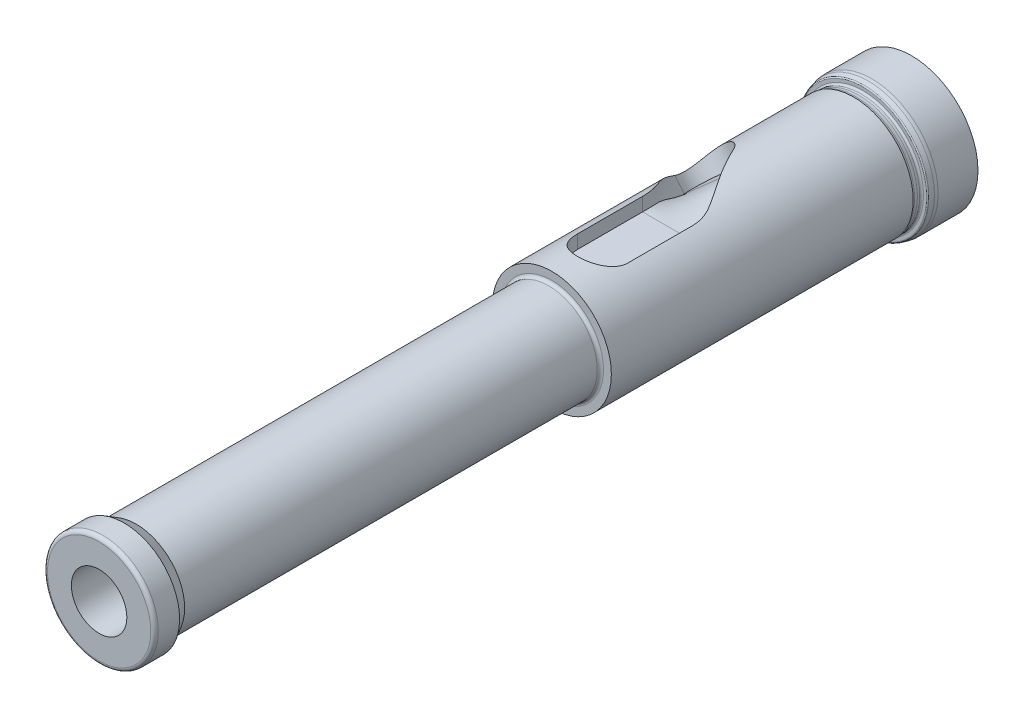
ISO-10303-21;
HEADER;
FILE_DESCRIPTION(('STEP AP214'),'2;1');
FILE_NAME('part.step','',(''),(''),'','','');
FILE_SCHEMA(('AUTOMOTIVE_DESIGN { 1 0 10303 214 1 1 1 1 }'));
ENDSEC;
DATA;
#1=APPLICATION_CONTEXT('core data for automotive mechanical design processes');
#2=APPLICATION_PROTOCOL_DEFINITION('international standard','automotive_design',2000,#1);
#3=PRODUCT_CONTEXT('',#1,'mechanical');
#4=PRODUCT('Part','Part','',(#3));
#5=PRODUCT_RELATED_PRODUCT_CATEGORY('part','',(#4));
#6=PRODUCT_DEFINITION_FORMATION('','',#4);
#7=PRODUCT_DEFINITION_CONTEXT('part definition',#1,'design');
#8=PRODUCT_DEFINITION('design','',#6,#7);
#9=PRODUCT_DEFINITION_SHAPE('','',#8);
#10=(LENGTH_UNIT() NAMED_UNIT(*) SI_UNIT(.MILLI.,.METRE.));
#11=(NAMED_UNIT(*) PLANE_ANGLE_UNIT() SI_UNIT($,.RADIAN.));
#12=(NAMED_UNIT(*) SI_UNIT($,.STERADIAN.) SOLID_ANGLE_UNIT());
#13=UNCERTAINTY_MEASURE_WITH_UNIT(LENGTH_MEASURE(1.E-05),#10,'distance_accuracy_value','');
#14=(GEOMETRIC_REPRESENTATION_CONTEXT(3) GLOBAL_UNCERTAINTY_ASSIGNED_CONTEXT((#13)) GLOBAL_UNIT_ASSIGNED_CONTEXT((#10,
#11,#12)) REPRESENTATION_CONTEXT('',''));
#15=CARTESIAN_POINT('',(0.,0.,0.));
#16=DIRECTION('',(0.,0.,1.));
#17=DIRECTION('',(1.,0.,0.));
#18=AXIS2_PLACEMENT_3D('',#15,#16,#17);
#19=CARTESIAN_POINT('',(0.,0.,20.9919525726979));
#20=DIRECTION('',(0.,0.,1.));
#21=DIRECTION('',(1.,0.,0.));
#22=AXIS2_PLACEMENT_3D('',#19,#20,#21);
#23=CYLINDRICAL_SURFACE('',#22,9.5);
#24=DIRECTION('',(0.,0.,1.));
#25=VECTOR('',#24,1.);
#26=CARTESIAN_POINT('',(-4.025,8.60519465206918,20.9919525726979));
#27=LINE('',#26,#25);
#28=CARTESIAN_POINT('',(-4.025,8.60519465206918,-80.425));
#29=VERTEX_POINT('',#28);
#30=CARTESIAN_POINT('',(-4.025,8.60519465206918,-90.8087010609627));
#31=VERTEX_POINT('',#30);
#32=EDGE_CURVE('E256',#29,#31,#27,.F.);
#33=ORIENTED_EDGE('',*,*,#32,.T.);
#34=CARTESIAN_POINT('',(-4.025,8.60519465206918,-90.8087010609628));
#35=CARTESIAN_POINT('',(-4.02499266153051,8.60519151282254,-90.9127536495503));
#36=CARTESIAN_POINT('',(-4.02745443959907,8.60404618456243,-91.0168248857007));
#37=CARTESIAN_POINT('',(-4.03758354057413,8.59930124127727,-91.225116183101));
#38=CARTESIAN_POINT('',(-4.04527382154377,8.5956908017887,-91.3293348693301));
#39=CARTESIAN_POINT('',(-4.06615097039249,8.58583380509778,-91.537298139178));
#40=CARTESIAN_POINT('',(-4.07934794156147,8.57958240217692,-91.6410414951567));
#41=CARTESIAN_POINT('',(-4.11093870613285,8.56448959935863,-91.8444077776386));
#42=CARTESIAN_POINT('',(-4.12916828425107,8.55572975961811,-91.9440621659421));
#43=CARTESIAN_POINT('',(-4.1710090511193,8.53540993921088,-92.1417876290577));
#44=CARTESIAN_POINT('',(-4.19461196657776,8.52385426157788,-92.2398608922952));
#45=CARTESIAN_POINT('',(-4.24712492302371,8.49781070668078,-92.4339308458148));
#46=CARTESIAN_POINT('',(-4.27602204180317,8.48332996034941,-92.5299319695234));
#47=CARTESIAN_POINT('',(-4.32717444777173,8.45730724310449,-92.6840340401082));
#48=CARTESIAN_POINT('',(-4.34784724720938,8.44670460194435,-92.7428257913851));
#49=CARTESIAN_POINT('',(-4.39115921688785,8.42426946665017,-92.859451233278));
#50=CARTESIAN_POINT('',(-4.41379858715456,8.4124368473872,-92.9172848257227));
#51=CARTESIAN_POINT('',(-4.46100141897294,8.3875013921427,-93.0319889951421));
#52=CARTESIAN_POINT('',(-4.48556769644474,8.37439669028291,-93.088858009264));
#53=CARTESIAN_POINT('',(-4.52376426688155,8.35378752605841,-93.1733091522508));
#54=CARTESIAN_POINT('',(-4.53672007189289,8.34675962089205,-93.2013156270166));
#55=CARTESIAN_POINT('',(-4.56306812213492,8.33238468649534,-93.2570392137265));
#56=CARTESIAN_POINT('',(-4.57646035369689,8.32503766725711,-93.2847563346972));
#57=CARTESIAN_POINT('',(-4.60371616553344,8.30999641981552,-93.3399880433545));
#58=CARTESIAN_POINT('',(-4.61758120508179,8.30230108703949,-93.3675016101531));
#59=CARTESIAN_POINT('',(-4.63868401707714,8.29051720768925,-93.4085458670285));
#60=CARTESIAN_POINT('',(-4.64576929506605,8.28654902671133,-93.4221898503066));
#61=CARTESIAN_POINT('',(-4.66004738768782,8.27852796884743,-93.4493965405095));
#62=CARTESIAN_POINT('',(-4.66724020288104,8.27447509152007,-93.4629592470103));
#63=CARTESIAN_POINT('',(-4.68170158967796,8.26630141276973,-93.4900263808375));
#64=CARTESIAN_POINT('',(-4.68897017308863,8.26218060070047,-93.5035307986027));
#65=CARTESIAN_POINT('',(-4.7035041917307,8.25391534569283,-93.5305340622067));
#66=CARTESIAN_POINT('',(-4.71076962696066,8.2497709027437,-93.5440329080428));
#67=CARTESIAN_POINT('',(-4.73258798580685,8.23728665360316,-93.5845017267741));
#68=CARTESIAN_POINT('',(-4.7471630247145,8.22889589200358,-93.6114440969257));
#69=CARTESIAN_POINT('',(-4.77636470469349,8.21198059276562,-93.6652755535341));
#70=CARTESIAN_POINT('',(-4.79099136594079,8.20345599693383,-93.6921646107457));
#71=CARTESIAN_POINT('',(-4.82029343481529,8.18627263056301,-93.745872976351));
#72=CARTESIAN_POINT('',(-4.83496884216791,8.17761386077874,-93.7726922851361));
#73=CARTESIAN_POINT('',(-4.87906356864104,8.15143591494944,-93.8530386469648));
#74=CARTESIAN_POINT('',(-4.90855467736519,8.13371320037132,-93.9064601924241));
#75=CARTESIAN_POINT('',(-4.96813517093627,8.09746044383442,-94.0137458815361));
#76=CARTESIAN_POINT('',(-4.99822719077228,8.07892262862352,-94.067605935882));
#77=CARTESIAN_POINT('',(-5.0586007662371,8.04125762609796,-94.175015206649));
#78=CARTESIAN_POINT('',(-5.08888232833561,8.02213041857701,-94.2285644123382));
#79=CARTESIAN_POINT('',(-5.17986732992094,7.96392817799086,-94.3884987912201));
#80=CARTESIAN_POINT('',(-5.24084117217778,7.92395353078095,-94.4944049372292));
#81=CARTESIAN_POINT('',(-5.36333223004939,7.84156284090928,-94.7047583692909));
#82=CARTESIAN_POINT('',(-5.42484871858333,7.79914973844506,-94.8092072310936));
#83=CARTESIAN_POINT('',(-5.54832861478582,7.71179411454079,-95.0167416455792));
#84=CARTESIAN_POINT('',(-5.61029192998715,7.66685210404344,-95.1198274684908));
#85=CARTESIAN_POINT('',(-5.75842430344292,7.55658963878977,-95.3641818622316));
#86=CARTESIAN_POINT('',(-5.84471483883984,7.49009301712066,-95.5048477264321));
#87=CARTESIAN_POINT('',(-6.01721803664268,7.35222986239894,-95.7839750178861));
#88=CARTESIAN_POINT('',(-6.1034306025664,7.28085996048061,-95.922434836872));
#89=CARTESIAN_POINT('',(-6.27499906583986,7.13352448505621,-96.197457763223));
#90=CARTESIAN_POINT('',(-6.36035483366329,7.05755822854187,-96.334020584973));
#91=CARTESIAN_POINT('',(-6.52880697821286,6.90200868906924,-96.6047513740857));
#92=CARTESIAN_POINT('',(-6.61191536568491,6.82245616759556,-96.7389295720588));
#93=CARTESIAN_POINT('',(-6.77576324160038,6.65975661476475,-97.0065129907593));
#94=CARTESIAN_POINT('',(-6.856503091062,6.57661013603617,-97.1399183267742));
#95=CARTESIAN_POINT('',(-7.01492851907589,6.40735632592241,-97.4066937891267));
#96=CARTESIAN_POINT('',(-7.09261370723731,6.32124861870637,-97.5400639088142));
#97=CARTESIAN_POINT('',(-7.24541385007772,6.14554602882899,-97.8095422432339));
#98=CARTESIAN_POINT('',(-7.32047176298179,6.05591803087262,-97.9456612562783));
#99=CARTESIAN_POINT('',(-7.46611171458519,5.87542510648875,-98.219440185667));
#100=CARTESIAN_POINT('',(-7.53669433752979,5.78456034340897,-98.3570998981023));
#101=CARTESIAN_POINT('',(-7.67279135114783,5.60278109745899,-98.6347757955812));
#102=CARTESIAN_POINT('',(-7.73830807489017,5.51186665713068,-98.7747908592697));
#103=CARTESIAN_POINT('',(-7.86433040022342,5.33053499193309,-99.0593538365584));
#104=CARTESIAN_POINT('',(-7.92478723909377,5.24012904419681,-99.2039306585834));
#105=CARTESIAN_POINT('',(-8.03956423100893,5.06227272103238,-99.4974362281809));
#106=CARTESIAN_POINT('',(-8.09388113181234,4.97482392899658,-99.6463672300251));
#107=CARTESIAN_POINT('',(-8.17039273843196,4.84738639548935,-99.8737971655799));
#108=CARTESIAN_POINT('',(-8.19509780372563,4.80547848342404,-99.9503802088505));
#109=CARTESIAN_POINT('',(-8.24276077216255,4.72325729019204,-100.104953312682));
#110=CARTESIAN_POINT('',(-8.26571831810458,4.68294433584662,-100.182943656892));
#111=CARTESIAN_POINT('',(-8.28776601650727,4.64359068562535,-100.261682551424));
#112=B_SPLINE_CURVE_WITH_KNOTS('',3,(#34,#35,#36,#37,#38,#39,#40,#41,#42,#43,#44,#45,#46,#47,
#48,#49,#50,#51,#52,#53,#54,#55,#56,#57,#58,#59,#60,#61,#62,#63,#64,#65,#66,#67,#68,#69,#70,#71,
#72,#73,#74,#75,#76,#77,#78,#79,#80,#81,#82,#83,#84,#85,#86,#87,#88,#89,#90,#91,#92,#93,#94,#95,
#96,#97,#98,#99,#100,#101,#102,#103,#104,#105,#106,#107,#108,#109,#110,#111),.UNSPECIFIED.,.F.,
.F.,(4,2,2,2,2,2,2,2,2,2,2,2,2,2,2,2,2,2,2,2,2,2,2,2,2,2,2,2,2,2,2,2,2,2,2,2,2,2,4),(0.,
0.312149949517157,0.625679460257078,0.939786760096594,1.24465816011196,1.5490632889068,
1.85273508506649,2.04233791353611,2.23196004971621,2.42186464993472,2.51680426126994,
2.61174090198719,2.70700320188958,2.75463608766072,2.80226922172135,2.84990989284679,
2.89755058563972,2.99283156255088,3.08815518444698,3.18347827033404,3.37410299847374,
3.56736269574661,3.76062902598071,4.14632391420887,4.53156312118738,4.91672477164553,
5.45038998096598,5.98442791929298,6.51854541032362,7.04872896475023,7.57883128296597,
8.10900113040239,8.64723233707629,9.18539313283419,9.72330458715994,10.2659139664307,
10.8088094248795,11.0809561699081,11.3531583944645),.UNSPECIFIED.);
#113=CARTESIAN_POINT('',(-8.2877660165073,4.64359068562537,-100.261682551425));
#114=VERTEX_POINT('',#113);
#115=EDGE_CURVE('E264',#31,#114,#112,.T.);
#116=ORIENTED_EDGE('',*,*,#115,.T.);
#117=CARTESIAN_POINT('',(-8.2877660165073,4.64359068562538,-100.261682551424));
#118=CARTESIAN_POINT('',(-8.31365934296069,4.5973664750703,-100.35415114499));
#119=CARTESIAN_POINT('',(-8.33739932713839,4.55409855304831,-100.448718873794));
#120=CARTESIAN_POINT('',(-8.38063239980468,4.47404717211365,-100.641541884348));
#121=CARTESIAN_POINT('',(-8.40012382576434,4.43726625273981,-100.739798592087));
#122=CARTESIAN_POINT('',(-8.43491401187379,4.3707699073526,-100.939499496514));
#123=CARTESIAN_POINT('',(-8.45020924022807,4.34106043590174,-101.040946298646));
#124=CARTESIAN_POINT('',(-8.47661977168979,4.28926166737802,-101.246288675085));
#125=CARTESIAN_POINT('',(-8.48773567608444,4.26717127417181,-101.350183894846));
#126=CARTESIAN_POINT('',(-8.50584033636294,4.23096818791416,-101.56000311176));
#127=CARTESIAN_POINT('',(-8.51281795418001,4.21687702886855,-101.66593179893));
#128=CARTESIAN_POINT('',(-8.5226162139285,4.19703898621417,-101.878799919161));
#129=CARTESIAN_POINT('',(-8.52543534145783,4.19129514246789,-101.985739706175));
#130=CARTESIAN_POINT('',(-8.52691636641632,4.18828129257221,-102.19959756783));
#131=CARTESIAN_POINT('',(-8.52558486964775,4.19099782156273,-102.306515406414));
#132=CARTESIAN_POINT('',(-8.51877534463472,4.20482166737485,-102.519711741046));
#133=CARTESIAN_POINT('',(-8.51329579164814,4.21593206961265,-102.62598998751));
#134=CARTESIAN_POINT('',(-8.49845968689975,4.24575664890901,-102.833106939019));
#135=CARTESIAN_POINT('',(-8.48925641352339,4.26416969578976,-102.934000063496));
#136=CARTESIAN_POINT('',(-8.4669775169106,4.30823550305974,-103.133769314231));
#137=CARTESIAN_POINT('',(-8.45390051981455,4.33389083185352,-103.232644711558));
#138=CARTESIAN_POINT('',(-8.40879897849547,4.42113591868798,-103.525367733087));
#139=CARTESIAN_POINT('',(-8.37090005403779,4.49301295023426,-103.715366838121));
#140=CARTESIAN_POINT('',(-8.27704727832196,4.66372569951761,-104.088902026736));
#141=CARTESIAN_POINT('',(-8.22035125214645,4.76363802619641,-104.271752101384));
#142=CARTESIAN_POINT('',(-8.08891580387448,4.98355685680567,-104.617851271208));
#143=CARTESIAN_POINT('',(-8.01417125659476,5.10356906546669,-104.781094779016));
#144=CARTESIAN_POINT('',(-7.83894649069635,5.3691963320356,-105.097630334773));
#145=CARTESIAN_POINT('',(-7.73682997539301,5.51611600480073,-105.248929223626));
#146=CARTESIAN_POINT('',(-7.51028469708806,5.8207924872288,-105.520935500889));
#147=CARTESIAN_POINT('',(-7.38585335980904,5.97855054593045,-105.641639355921));
#148=CARTESIAN_POINT('',(-7.11504145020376,6.29842178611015,-105.848763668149));
#149=CARTESIAN_POINT('',(-6.96862380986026,6.4605419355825,-105.935125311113));
#150=CARTESIAN_POINT('',(-6.65633948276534,6.78182852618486,-106.06968751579));
#151=CARTESIAN_POINT('',(-6.49048508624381,6.94099676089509,-106.117912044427));
#152=CARTESIAN_POINT('',(-6.15626934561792,7.23856163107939,-106.171923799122));
#153=CARTESIAN_POINT('',(-5.98895599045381,7.37762805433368,-106.180526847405));
#154=CARTESIAN_POINT('',(-5.64633910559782,7.64302133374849,-106.162591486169));
#155=CARTESIAN_POINT('',(-5.47103708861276,7.76935058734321,-106.136059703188));
#156=CARTESIAN_POINT('',(-5.12463322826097,8.00188347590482,-106.050613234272));
#157=CARTESIAN_POINT('',(-4.95360763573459,8.10864825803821,-105.992899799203));
#158=CARTESIAN_POINT('',(-4.61481286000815,8.30614169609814,-105.848017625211));
#159=CARTESIAN_POINT('',(-4.44704462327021,8.39686575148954,-105.760840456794));
#160=CARTESIAN_POINT('',(-4.11218924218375,8.56602293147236,-105.554934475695));
#161=CARTESIAN_POINT('',(-3.94550527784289,8.64367725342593,-105.434914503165));
#162=CARTESIAN_POINT('',(-3.62678183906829,8.78217904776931,-105.168646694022));
#163=CARTESIAN_POINT('',(-3.47474151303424,8.84302749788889,-105.022400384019));
#164=CARTESIAN_POINT('',(-3.22050073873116,8.9382752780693,-104.74011425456));
#165=CARTESIAN_POINT('',(-3.11454216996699,8.97554571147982,-104.608392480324));
#166=CARTESIAN_POINT('',(-2.91772411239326,9.04143970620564,-104.332393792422));
#167=CARTESIAN_POINT('',(-2.82684629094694,9.07007380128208,-104.188132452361));
#168=CARTESIAN_POINT('',(-2.74469424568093,9.09486962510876,-104.038317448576));
#169=B_SPLINE_CURVE_WITH_KNOTS('',3,(#117,#118,#119,#120,#121,#122,#123,#124,#125,#126,#127,
#128,#129,#130,#131,#132,#133,#134,#135,#136,#137,#138,#139,#140,#141,#142,#143,#144,#145,#146,
#147,#148,#149,#150,#151,#152,#153,#154,#155,#156,#157,#158,#159,#160,#161,#162,#163,#164,#165,
#166,#167,#168),.UNSPECIFIED.,.F.,.F.,(4,2,2,2,2,2,2,2,2,2,2,2,2,2,2,2,2,2,2,2,2,2,2,2,2,4),(0.,
0.319657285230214,0.639439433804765,0.959489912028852,1.27949432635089,1.60035615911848,
1.92133481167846,2.24180288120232,2.56238880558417,2.87093890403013,3.17959856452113,
3.79675367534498,4.4419528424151,5.08733544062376,5.78702319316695,6.48679171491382,
7.18775354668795,7.88827451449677,8.5381539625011,9.18791085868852,9.81425602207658,
10.4407805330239,11.0967733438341,11.7527279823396,12.2707792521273,12.7881960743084),.UNSPECIFIED.);
#170=CARTESIAN_POINT('',(-2.74469424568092,9.09486962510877,-104.038317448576));
#171=VERTEX_POINT('',#170);
#172=EDGE_CURVE('E13',#114,#171,#169,.T.);
#173=ORIENTED_EDGE('',*,*,#172,.T.);
#174=CARTESIAN_POINT('',(-2.74469424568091,9.09486962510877,-104.038317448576));
#175=CARTESIAN_POINT('',(-2.69367428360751,9.11026766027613,-103.945299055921));
#176=CARTESIAN_POINT('',(-2.64240624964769,9.12527018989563,-103.852352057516));
#177=CARTESIAN_POINT('',(-2.53946216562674,9.15445190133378,-103.666554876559));
#178=CARTESIAN_POINT('',(-2.48778611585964,9.16863108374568,-103.573704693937));
#179=CARTESIAN_POINT('',(-2.33224867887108,9.20989292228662,-103.295177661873));
#180=CARTESIAN_POINT('',(-2.22790698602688,9.23569111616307,-103.109576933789));
#181=CARTESIAN_POINT('',(-2.01821874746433,9.28376935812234,-102.738445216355));
#182=CARTESIAN_POINT('',(-1.91287202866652,9.306048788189,-102.552914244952));
#183=CARTESIAN_POINT('',(-1.70116022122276,9.34706813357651,-102.182025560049));
#184=CARTESIAN_POINT('',(-1.5947950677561,9.36580782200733,-101.996667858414));
#185=CARTESIAN_POINT('',(-1.38157594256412,9.39961826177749,-101.627527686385));
#186=CARTESIAN_POINT('',(-1.2747297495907,9.41471226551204,-101.443742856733));
#187=CARTESIAN_POINT('',(-1.05965716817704,9.44133816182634,-101.076738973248));
#188=CARTESIAN_POINT('',(-0.951430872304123,9.45287029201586,-100.893519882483));
#189=CARTESIAN_POINT('',(-0.73344132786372,9.47227714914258,-100.527822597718));
#190=CARTESIAN_POINT('',(-0.623678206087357,9.48015217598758,-100.345344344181));
#191=CARTESIAN_POINT('',(-0.402571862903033,9.49211207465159,-99.9812364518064));
#192=CARTESIAN_POINT('',(-0.291228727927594,9.4961971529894,-99.799606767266));
#193=CARTESIAN_POINT('',(-0.0373492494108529,9.5009846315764,-99.3891974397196));
#194=CARTESIAN_POINT('',(0.105633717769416,9.50050364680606,-99.1606788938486));
#195=CARTESIAN_POINT('',(0.393421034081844,9.49294112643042,-98.7048907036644));
#196=CARTESIAN_POINT('',(0.53822545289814,9.48585933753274,-98.4776211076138));
#197=CARTESIAN_POINT('',(0.828731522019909,9.46490393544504,-98.0239634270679));
#198=CARTESIAN_POINT('',(0.974433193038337,9.45103016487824,-97.7975753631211));
#199=CARTESIAN_POINT('',(1.26634147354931,9.41637372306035,-97.3438984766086));
#200=CARTESIAN_POINT('',(1.41254649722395,9.39555374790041,-97.1166114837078));
#201=CARTESIAN_POINT('',(1.70329353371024,9.34721928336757,-96.661686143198));
#202=CARTESIAN_POINT('',(1.84783554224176,9.31970477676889,-96.4340477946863));
#203=CARTESIAN_POINT('',(2.13382448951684,9.25841093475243,-95.9776454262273));
#204=CARTESIAN_POINT('',(2.27527125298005,9.22463124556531,-95.7488813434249));
#205=CARTESIAN_POINT('',(2.45830959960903,9.17653415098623,-95.4467839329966));
#206=CARTESIAN_POINT('',(2.50195369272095,9.16472905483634,-95.374285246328));
#207=CARTESIAN_POINT('',(2.58874529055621,9.14059213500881,-95.2290803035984));
#208=CARTESIAN_POINT('',(2.63189280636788,9.12826032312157,-95.1563740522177));
#209=CARTESIAN_POINT('',(2.71764615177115,9.10309818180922,-95.010733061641));
#210=CARTESIAN_POINT('',(2.76025200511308,9.09026787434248,-94.9377983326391));
#211=CARTESIAN_POINT('',(2.8237254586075,9.07067058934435,-94.8282043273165));
#212=CARTESIAN_POINT('',(2.84481136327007,9.06407931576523,-94.7916398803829));
#213=CARTESIAN_POINT('',(2.88683151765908,9.05078391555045,-94.718444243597));
#214=CARTESIAN_POINT('',(2.90776576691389,9.04407978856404,-94.6818130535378));
#215=CARTESIAN_POINT('',(2.94948385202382,9.03056064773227,-94.6084789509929));
#216=CARTESIAN_POINT('',(2.97026766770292,9.02374561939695,-94.5717760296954));
#217=CARTESIAN_POINT('',(3.00131382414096,9.01344742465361,-94.5166628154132));
#218=CARTESIAN_POINT('',(3.0116409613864,9.01000207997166,-94.4982819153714));
#219=CARTESIAN_POINT('',(3.0322697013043,9.00308049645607,-94.4615115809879));
#220=CARTESIAN_POINT('',(3.04257130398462,8.99960425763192,-94.4431221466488));
#221=CARTESIAN_POINT('',(3.06306842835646,8.99264861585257,-94.4062866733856));
#222=CARTESIAN_POINT('',(3.07326395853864,8.98916921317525,-94.3878406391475));
#223=CARTESIAN_POINT('',(3.09351456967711,8.98222034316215,-94.3508698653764));
#224=CARTESIAN_POINT('',(3.10356965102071,8.97875087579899,-94.3323451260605));
#225=CARTESIAN_POINT('',(3.13353391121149,8.96835615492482,-94.2766609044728));
#226=CARTESIAN_POINT('',(3.15324250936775,8.96144444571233,-94.2393906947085));
#227=CARTESIAN_POINT('',(3.19189812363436,8.9477484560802,-94.1649503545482));
#228=CARTESIAN_POINT('',(3.21085101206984,8.94096360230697,-94.12778337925));
#229=CARTESIAN_POINT('',(3.24820286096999,8.92746170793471,-94.0531594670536));
#230=CARTESIAN_POINT('',(3.26660181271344,8.92074466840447,-94.0157025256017));
#231=CARTESIAN_POINT('',(3.32095072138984,8.90071779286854,-93.9028929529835));
#232=CARTESIAN_POINT('',(3.35605042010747,8.88753302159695,-93.827106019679));
#233=CARTESIAN_POINT('',(3.42386339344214,8.8616294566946,-93.6744327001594));
#234=CARTESIAN_POINT('',(3.45657770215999,8.8489104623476,-93.5975468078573));
#235=CARTESIAN_POINT('',(3.51953449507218,8.82405925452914,-93.4426827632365));
#236=CARTESIAN_POINT('',(3.54977704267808,8.81192702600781,-93.3647046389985));
#237=CARTESIAN_POINT('',(3.63661819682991,8.77661194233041,-93.1292694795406));
#238=CARTESIAN_POINT('',(3.68937902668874,8.75449182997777,-92.970202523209));
#239=CARTESIAN_POINT('',(3.76784206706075,8.72092405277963,-92.7030663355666));
#240=CARTESIAN_POINT('',(3.79664763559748,8.7084035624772,-92.5960292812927));
#241=CARTESIAN_POINT('',(3.84930021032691,8.6852585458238,-92.3805118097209));
#242=CARTESIAN_POINT('',(3.8731464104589,8.67463432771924,-92.2720311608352));
#243=CARTESIAN_POINT('',(3.91572710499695,8.65549692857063,-92.0538864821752));
#244=CARTESIAN_POINT('',(3.93446158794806,8.64698375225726,-91.9442224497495));
#245=CARTESIAN_POINT('',(3.96713477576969,8.63204327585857,-91.7211428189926));
#246=CARTESIAN_POINT('',(3.98093771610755,8.62567526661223,-91.6077032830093));
#247=CARTESIAN_POINT('',(4.0030032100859,8.61545831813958,-91.3801728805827));
#248=CARTESIAN_POINT('',(4.01126570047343,8.61160940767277,-91.2660820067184));
#249=CARTESIAN_POINT('',(4.02226995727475,8.60647134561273,-91.0375606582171));
#250=CARTESIAN_POINT('',(4.02501095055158,8.60518255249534,-90.923130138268));
#251=CARTESIAN_POINT('',(4.025,8.60519465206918,-90.8087010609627));
#252=B_SPLINE_CURVE_WITH_KNOTS('',3,(#174,#175,#176,#177,#178,#179,#180,#181,#182,#183,#184,
#185,#186,#187,#188,#189,#190,#191,#192,#193,#194,#195,#196,#197,#198,#199,#200,#201,#202,#203,
#204,#205,#206,#207,#208,#209,#210,#211,#212,#213,#214,#215,#216,#217,#218,#219,#220,#221,#222,
#223,#224,#225,#226,#227,#228,#229,#230,#231,#232,#233,#234,#235,#236,#237,#238,#239,#240,#241,
#242,#243,#244,#245,#246,#247,#248,#249,#250,#251),.UNSPECIFIED.,.F.,.F.,(4,2,2,2,2,2,2,2,2,2,2,
2,2,2,2,2,2,2,2,2,2,2,2,2,2,2,2,2,2,2,2,2,2,2,2,2,2,2,4),(0.,0.3216077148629,0.64321519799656,
1.28661222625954,1.9301221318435,2.57367327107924,3.21300448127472,3.85229303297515,
4.49152914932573,5.13073043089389,5.93933165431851,6.7479639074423,7.55661489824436,
8.36968051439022,9.18274822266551,9.99586185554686,10.2521837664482,10.5084999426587,
10.764804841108,10.8929651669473,11.0211258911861,11.1493034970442,11.2133924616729,
11.277481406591,11.3415651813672,11.405648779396,11.5338134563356,11.6606143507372,
11.7874172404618,12.0410382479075,12.2945486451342,12.5480525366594,13.0546980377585,
13.3892325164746,13.7238213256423,14.0584108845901,14.4016074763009,14.7448079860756,
15.0880565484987),.UNSPECIFIED.);
#253=CARTESIAN_POINT('',(4.025,8.60519465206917,-90.8087010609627));
#254=VERTEX_POINT('',#253);
#255=EDGE_CURVE('E793',#171,#254,#252,.T.);
#256=ORIENTED_EDGE('',*,*,#255,.T.);
#257=DIRECTION('',(0.,0.,1.));
#258=VECTOR('',#257,1.);
#259=CARTESIAN_POINT('',(4.025,8.60519465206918,20.9919525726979));
#260=LINE('',#259,#258);
#261=CARTESIAN_POINT('',(4.025,8.60519465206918,-80.425));
#262=VERTEX_POINT('',#261);
#263=EDGE_CURVE('E487',#254,#262,#260,.T.);
#264=ORIENTED_EDGE('',*,*,#263,.T.);
#265=CARTESIAN_POINT('',(-4.025,8.60519465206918,-80.425));
#266=CARTESIAN_POINT('',(-4.02499918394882,8.60519550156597,-80.3178009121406));
#267=CARTESIAN_POINT('',(-4.02071097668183,8.60720486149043,-80.2105656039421));
#268=CARTESIAN_POINT('',(-4.00360355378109,8.61517523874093,-79.996879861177));
#269=CARTESIAN_POINT('',(-3.99077889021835,8.62113877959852,-79.8904299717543));
#270=CARTESIAN_POINT('',(-3.95670278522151,8.63683140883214,-79.6789315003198));
#271=CARTESIAN_POINT('',(-3.93543376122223,8.64656835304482,-79.5738863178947));
#272=CARTESIAN_POINT('',(-3.88470567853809,8.66947678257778,-79.3661610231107));
#273=CARTESIAN_POINT('',(-3.85524316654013,8.68264971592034,-79.2634819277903));
#274=CARTESIAN_POINT('',(-3.75527845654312,8.7265812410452,-78.9609706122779));
#275=CARTESIAN_POINT('',(-3.67301414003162,8.761843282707,-78.7655370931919));
#276=CARTESIAN_POINT('',(-3.47987324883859,8.8403214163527,-78.3914015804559));
#277=CARTESIAN_POINT('',(-3.36900276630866,8.88353581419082,-78.2126960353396));
#278=CARTESIAN_POINT('',(-3.11413141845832,8.97616817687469,-77.8653424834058));
#279=CARTESIAN_POINT('',(-2.96857379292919,9.02580104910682,-77.6978914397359));
#280=CARTESIAN_POINT('',(-2.6517348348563,9.1239132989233,-77.3888949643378));
#281=CARTESIAN_POINT('',(-2.48044343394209,9.17239221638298,-77.2473597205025));
#282=CARTESIAN_POINT('',(-2.10751069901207,9.26536099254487,-76.9880145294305));
#283=CARTESIAN_POINT('',(-1.90484875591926,9.30957220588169,-76.8715630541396));
#284=CARTESIAN_POINT('',(-1.4805987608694,9.38638311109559,-76.6749278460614));
#285=CARTESIAN_POINT('',(-1.25901943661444,9.41898812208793,-76.5947274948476));
#286=CARTESIAN_POINT('',(-0.815818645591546,9.46738785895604,-76.4772453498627));
#287=CARTESIAN_POINT('',(-0.59483577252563,9.4839898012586,-76.43789389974));
#288=CARTESIAN_POINT('',(-0.14882204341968,9.50145128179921,-76.3965291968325));
#289=CARTESIAN_POINT('',(0.076207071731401,9.5023174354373,-76.3945002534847));
#290=CARTESIAN_POINT('',(0.508838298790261,9.48867802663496,-76.4267754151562));
#291=CARTESIAN_POINT('',(0.716646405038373,9.47513571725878,-76.458802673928));
#292=CARTESIAN_POINT('',(1.12361396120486,9.43553433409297,-76.5543649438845));
#293=CARTESIAN_POINT('',(1.32277277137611,9.40947433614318,-76.6179022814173));
#294=CARTESIAN_POINT('',(1.71045986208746,9.34684486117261,-76.7754221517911));
#295=CARTESIAN_POINT('',(1.89877899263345,9.31012075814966,-76.869855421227));
#296=CARTESIAN_POINT('',(2.25739253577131,9.22973464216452,-77.0860356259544));
#297=CARTESIAN_POINT('',(2.42768048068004,9.18607015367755,-77.2077923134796));
#298=CARTESIAN_POINT('',(2.75852696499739,9.09242535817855,-77.4854244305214));
#299=CARTESIAN_POINT('',(2.91748389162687,9.04221666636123,-77.6431340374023));
#300=CARTESIAN_POINT('',(3.20740057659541,8.94349405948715,-77.9830464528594));
#301=CARTESIAN_POINT('',(3.3383487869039,8.89498085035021,-78.1652593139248));
#302=CARTESIAN_POINT('',(3.57284206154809,8.80347848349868,-78.5570294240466));
#303=CARTESIAN_POINT('',(3.67526918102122,8.76074171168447,-78.7673198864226));
#304=CARTESIAN_POINT('',(3.84259746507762,8.68866174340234,-79.204454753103));
#305=CARTESIAN_POINT('',(3.90752652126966,8.65930859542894,-79.4312867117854));
#306=CARTESIAN_POINT('',(3.99386689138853,8.61981145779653,-79.8789967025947));
#307=CARTESIAN_POINT('',(4.01788220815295,8.60852109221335,-80.0992695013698));
#308=CARTESIAN_POINT('',(4.02938365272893,8.60314681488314,-80.5409396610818));
#309=CARTESIAN_POINT('',(4.0168831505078,8.60905660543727,-80.7623365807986));
#310=CARTESIAN_POINT('',(3.95808621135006,8.63622912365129,-81.1842830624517));
#311=CARTESIAN_POINT('',(3.9141167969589,8.65643368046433,-81.3852339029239));
#312=CARTESIAN_POINT('',(3.79674191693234,8.70854999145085,-81.7767258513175));
#313=CARTESIAN_POINT('',(3.72332941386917,8.74046454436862,-81.9672644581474));
#314=CARTESIAN_POINT('',(3.54565751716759,8.81407452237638,-82.3416958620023));
#315=CARTESIAN_POINT('',(3.44020665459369,8.85613174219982,-82.5249498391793));
#316=CARTESIAN_POINT('',(3.20262324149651,8.94478989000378,-82.8720613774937));
#317=CARTESIAN_POINT('',(3.07047887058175,8.99139282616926,-83.0359102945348));
#318=CARTESIAN_POINT('',(2.77007230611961,9.08865471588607,-83.3540152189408));
#319=CARTESIAN_POINT('',(2.59969866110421,9.13932280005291,-83.5062824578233));
#320=CARTESIAN_POINT('',(2.23466293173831,9.23535945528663,-83.7804440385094));
#321=CARTESIAN_POINT('',(2.03999869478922,9.28072755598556,-83.9023356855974));
#322=CARTESIAN_POINT('',(1.63020358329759,9.36141865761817,-84.1123077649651));
#323=CARTESIAN_POINT('',(1.41499566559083,9.39670169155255,-84.2002541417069));
#324=CARTESIAN_POINT('',(0.97095454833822,9.45289357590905,-84.3380318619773));
#325=CARTESIAN_POINT('',(0.74212985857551,9.47381130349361,-84.387886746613));
#326=CARTESIAN_POINT('',(0.295094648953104,9.49786327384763,-84.4450289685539));
#327=CARTESIAN_POINT('',(0.0773028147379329,9.50216728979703,-84.455117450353));
#328=CARTESIAN_POINT('',(-0.356806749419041,9.49577674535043,-84.4400287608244));
#329=CARTESIAN_POINT('',(-0.573124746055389,9.48508497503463,-84.4148581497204));
#330=CARTESIAN_POINT('',(-0.989743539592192,9.45052965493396,-84.331977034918));
#331=CARTESIAN_POINT('',(-1.19034076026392,9.4271765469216,-84.2755257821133));
#332=CARTESIAN_POINT('',(-1.5791233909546,9.36989951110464,-84.1330831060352));
#333=CARTESIAN_POINT('',(-1.76730647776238,9.33597361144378,-84.0470861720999));
#334=CARTESIAN_POINT('',(-2.13535667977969,9.25889912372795,-83.843638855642));
#335=CARTESIAN_POINT('',(-2.31445645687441,9.21540128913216,-83.7249359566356));
#336=CARTESIAN_POINT('',(-2.6509696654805,9.12429727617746,-83.4612335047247));
#337=CARTESIAN_POINT('',(-2.80837468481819,9.07668951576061,-83.316223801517));
#338=CARTESIAN_POINT('',(-3.10861009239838,8.97848727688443,-82.9919830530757));
#339=CARTESIAN_POINT('',(-3.24962164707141,8.92791976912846,-82.8110567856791));
#340=CARTESIAN_POINT('',(-3.49962123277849,8.83292820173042,-82.426450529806));
#341=CARTESIAN_POINT('',(-3.60859095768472,8.78850766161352,-82.2227576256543));
#342=CARTESIAN_POINT('',(-3.74495726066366,8.73084784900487,-81.9046081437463));
#343=CARTESIAN_POINT('',(-3.78586944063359,8.71313686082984,-81.7965755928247));
#344=CARTESIAN_POINT('',(-3.8583700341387,8.68127611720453,-81.5769344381));
#345=CARTESIAN_POINT('',(-3.88996304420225,8.66712460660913,-81.4653276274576));
#346=CARTESIAN_POINT('',(-3.94338944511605,8.64294728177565,-81.2396895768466));
#347=CARTESIAN_POINT('',(-3.96524856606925,8.63291059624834,-81.1256655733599));
#348=CARTESIAN_POINT('',(-3.9990409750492,8.61730946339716,-80.8959111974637));
#349=CARTESIAN_POINT('',(-4.01098191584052,8.6117415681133,-80.7801822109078));
#350=CARTESIAN_POINT('',(-4.02025917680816,8.60741072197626,-80.6243340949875));
#351=CARTESIAN_POINT('',(-4.02203642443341,8.6065803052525,-80.5844945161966));
#352=CARTESIAN_POINT('',(-4.02440699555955,8.60547210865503,-80.5047716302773));
#353=CARTESIAN_POINT('',(-4.02500030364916,8.60519433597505,-80.4648883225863));
#354=CARTESIAN_POINT('',(-4.025,8.60519465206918,-80.425));
#355=B_SPLINE_CURVE_WITH_KNOTS('',3,(#265,#266,#267,#268,#269,#270,#271,#272,#273,#274,#275,
#276,#277,#278,#279,#280,#281,#282,#283,#284,#285,#286,#287,#288,#289,#290,#291,#292,#293,#294,
#295,#296,#297,#298,#299,#300,#301,#302,#303,#304,#305,#306,#307,#308,#309,#310,#311,#312,#313,
#314,#315,#316,#317,#318,#319,#320,#321,#322,#323,#324,#325,#326,#327,#328,#329,#330,#331,#332,
#333,#334,#335,#336,#337,#338,#339,#340,#341,#342,#343,#344,#345,#346,#347,#348,#349,#350,#351,
#352,#353,#354),.UNSPECIFIED.,.T.,.F.,(4,2,2,2,2,2,2,2,2,2,2,2,2,2,2,2,2,2,2,2,2,2,2,2,2,2,2,2,
2,2,2,2,2,2,2,2,2,2,2,2,2,2,2,2,4),(0.,0.321555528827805,0.643316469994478,0.965750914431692,
1.28832146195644,1.93006815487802,2.57167828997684,3.25076088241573,3.930109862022,
4.64010822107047,5.34978076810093,6.02142243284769,6.69278172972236,7.3219213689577,
7.9511074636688,8.589915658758,9.22895221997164,9.9143403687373,10.6000105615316,
11.3096496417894,12.0187602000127,12.6807717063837,13.3425408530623,13.9598487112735,
14.5773042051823,15.2213302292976,15.8656420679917,16.5645406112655,17.2635011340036,
17.9651943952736,18.6664536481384,19.3173266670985,19.9680786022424,20.5943591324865,
21.2207565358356,21.8756396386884,22.5307759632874,23.2322592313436,23.9341424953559,
24.2843559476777,24.634396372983,24.9835059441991,25.3323458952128,25.4519937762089,
25.5716432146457),.UNSPECIFIED.);
#356=EDGE_CURVE('E413',#29,#262,#355,.T.);
#357=ORIENTED_EDGE('',*,*,#356,.F.);
#358=EDGE_LOOP('',(#33,#116,#173,#256,#264,#357));
#359=FACE_BOUND('',#358,.T.);
#360=CARTESIAN_POINT('',(0.,0.,-120.5));
#361=DIRECTION('',(0.,0.,1.));
#362=DIRECTION('',(1.,0.,0.));
#363=AXIS2_PLACEMENT_3D('',#360,#361,#362);
#364=CIRCLE('',#363,9.5);
#365=CARTESIAN_POINT('',(9.5,0.,-120.5));
#366=VERTEX_POINT('',#365);
#367=EDGE_CURVE('E582',#366,#366,#364,.T.);
#368=ORIENTED_EDGE('',*,*,#367,.T.);
#369=EDGE_LOOP('',(#368));
#370=FACE_BOUND('',#369,.T.);
#371=CARTESIAN_POINT('',(0.,0.,-72.3));
#372=DIRECTION('',(0.,0.,1.));
#373=DIRECTION('',(1.,0.,0.));
#374=AXIS2_PLACEMENT_3D('',#371,#372,#373);
#375=CIRCLE('',#374,9.5);
#376=CARTESIAN_POINT('',(9.5,0.,-72.3));
#377=VERTEX_POINT('',#376);
#378=EDGE_CURVE('E591',#377,#377,#375,.T.);
#379=ORIENTED_EDGE('',*,*,#378,.F.);
#380=EDGE_LOOP('',(#379));
#381=FACE_BOUND('',#380,.T.);
#382=ADVANCED_FACE('F237',(#359,#370,#381),#23,.T.);
#383=CARTESIAN_POINT('',(0.,10.6,-129.75));
#384=DIRECTION('',(0.,0.,1.));
#385=DIRECTION('',(1.,0.,0.));
#386=AXIS2_PLACEMENT_3D('',#383,#384,#385);
#387=PLANE('',#386);
#388=CARTESIAN_POINT('',(0.,0.,-129.75));
#389=DIRECTION('',(0.,0.,1.));
#390=DIRECTION('',(1.,0.,0.));
#391=AXIS2_PLACEMENT_3D('',#388,#389,#390);
#392=CIRCLE('',#391,10.6);
#393=CARTESIAN_POINT('',(10.6,0.,-129.75));
#394=VERTEX_POINT('',#393);
#395=EDGE_CURVE('E833',#394,#394,#392,.T.);
#396=ORIENTED_EDGE('',*,*,#395,.F.);
#397=EDGE_LOOP('',(#396));
#398=FACE_BOUND('',#397,.T.);
#399=CARTESIAN_POINT('',(0.,0.,-129.75));
#400=DIRECTION('',(0.,0.,1.));
#401=DIRECTION('',(1.,0.,0.));
#402=AXIS2_PLACEMENT_3D('',#399,#400,#401);
#403=CIRCLE('',#402,4.4275);
#404=CARTESIAN_POINT('',(4.4275,0.,-129.75));
#405=VERTEX_POINT('',#404);
#406=EDGE_CURVE('E248',#405,#405,#403,.T.);
#407=ORIENTED_EDGE('',*,*,#406,.T.);
#408=EDGE_LOOP('',(#407));
#409=FACE_BOUND('',#408,.T.);
#410=ADVANCED_FACE('F239',(#398,#409),#387,.F.);
#411=CARTESIAN_POINT('',(0.,0.,20.9919525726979));
#412=DIRECTION('',(0.,0.,1.));
#413=DIRECTION('',(1.,0.,0.));
#414=AXIS2_PLACEMENT_3D('',#411,#412,#413);
#415=CYLINDRICAL_SURFACE('',#414,4.4275);
#416=ORIENTED_EDGE('',*,*,#406,.F.);
#417=EDGE_LOOP('',(#416));
#418=FACE_BOUND('',#417,.T.);
#419=CARTESIAN_POINT('',(0.,0.,0.));
#420=DIRECTION('',(0.,0.,1.));
#421=DIRECTION('',(1.,0.,0.));
#422=AXIS2_PLACEMENT_3D('',#419,#420,#421);
#423=CIRCLE('',#422,4.4275);
#424=CARTESIAN_POINT('',(4.4275,0.,0.));
#425=VERTEX_POINT('',#424);
#426=EDGE_CURVE('E612',#425,#425,#423,.T.);
#427=ORIENTED_EDGE('',*,*,#426,.T.);
#428=EDGE_LOOP('',(#427));
#429=FACE_BOUND('',#428,.T.);
#430=ADVANCED_FACE('F618',(#418,#429),#415,.F.);
#431=CARTESIAN_POINT('',(0.,4.4275,0.));
#432=DIRECTION('',(0.,0.,-1.));
#433=DIRECTION('',(-1.,0.,0.));
#434=AXIS2_PLACEMENT_3D('',#431,#432,#433);
#435=PLANE('',#434);
#436=ORIENTED_EDGE('',*,*,#426,.F.);
#437=EDGE_LOOP('',(#436));
#438=FACE_BOUND('',#437,.T.);
#439=CARTESIAN_POINT('',(0.,0.,0.));
#440=DIRECTION('',(0.,0.,1.));
#441=DIRECTION('',(1.,0.,0.));
#442=AXIS2_PLACEMENT_3D('',#439,#440,#441);
#443=CIRCLE('',#442,8.25);
#444=CARTESIAN_POINT('',(8.25,0.,0.));
#445=VERTEX_POINT('',#444);
#446=EDGE_CURVE('E609',#445,#445,#443,.T.);
#447=ORIENTED_EDGE('',*,*,#446,.T.);
#448=EDGE_LOOP('',(#447));
#449=FACE_BOUND('',#448,.T.);
#450=ADVANCED_FACE('F621',(#438,#449),#435,.F.);
#451=CARTESIAN_POINT('',(0.,0.,-0.6));
#452=DIRECTION('',(0.,0.,1.));
#453=DIRECTION('',(1.,0.,0.));
#454=AXIS2_PLACEMENT_3D('',#451,#452,#453);
#455=TOROIDAL_SURFACE('',#454,8.25,0.6);
#456=ORIENTED_EDGE('',*,*,#446,.F.);
#457=EDGE_LOOP('',(#456));
#458=FACE_BOUND('',#457,.T.);
#459=CARTESIAN_POINT('',(0.,0.,-0.600000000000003));
#460=DIRECTION('',(0.,0.,1.));
#461=DIRECTION('',(1.,0.,0.));
#462=AXIS2_PLACEMENT_3D('',#459,#460,#461);
#463=CIRCLE('',#462,8.85);
#464=CARTESIAN_POINT('',(8.85,0.,-0.600000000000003));
#465=VERTEX_POINT('',#464);
#466=EDGE_CURVE('E606',#465,#465,#463,.T.);
#467=ORIENTED_EDGE('',*,*,#466,.T.);
#468=EDGE_LOOP('',(#467));
#469=FACE_BOUND('',#468,.T.);
#470=ADVANCED_FACE('F626',(#458,#469),#455,.T.);
#471=CARTESIAN_POINT('',(0.,0.,20.9919525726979));
#472=DIRECTION('',(0.,0.,1.));
#473=DIRECTION('',(1.,0.,0.));
#474=AXIS2_PLACEMENT_3D('',#471,#472,#473);
#475=CYLINDRICAL_SURFACE('',#474,8.85);
#476=ORIENTED_EDGE('',*,*,#466,.F.);
#477=EDGE_LOOP('',(#476));
#478=FACE_BOUND('',#477,.T.);
#479=CARTESIAN_POINT('',(0.,0.,-4.));
#480=DIRECTION('',(0.,0.,1.));
#481=DIRECTION('',(1.,0.,0.));
#482=AXIS2_PLACEMENT_3D('',#479,#480,#481);
#483=CIRCLE('',#482,8.85);
#484=CARTESIAN_POINT('',(8.85,0.,-4.));
#485=VERTEX_POINT('',#484);
#486=EDGE_CURVE('E603',#485,#485,#483,.T.);
#487=ORIENTED_EDGE('',*,*,#486,.T.);
#488=EDGE_LOOP('',(#487));
#489=FACE_BOUND('',#488,.T.);
#490=ADVANCED_FACE('F632',(#478,#489),#475,.T.);
#491=CARTESIAN_POINT('',(0.,0.,-5.90525588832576));
#492=DIRECTION('',(0.,0.,1.));
#493=DIRECTION('',(1.,0.,0.));
#494=AXIS2_PLACEMENT_3D('',#491,#492,#493);
#495=CONICAL_SURFACE('',#494,7.75,0.523598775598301);
#496=ORIENTED_EDGE('',*,*,#486,.F.);
#497=EDGE_LOOP('',(#496));
#498=FACE_BOUND('',#497,.T.);
#499=CARTESIAN_POINT('',(0.,0.,-5.90525588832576));
#500=DIRECTION('',(0.,0.,1.));
#501=DIRECTION('',(1.,0.,0.));
#502=AXIS2_PLACEMENT_3D('',#499,#500,#501);
#503=CIRCLE('',#502,7.75);
#504=CARTESIAN_POINT('',(7.75,0.,-5.90525588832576));
#505=VERTEX_POINT('',#504);
#506=EDGE_CURVE('E600',#505,#505,#503,.T.);
#507=ORIENTED_EDGE('',*,*,#506,.T.);
#508=EDGE_LOOP('',(#507));
#509=FACE_BOUND('',#508,.T.);
#510=ADVANCED_FACE('F638',(#498,#509),#495,.T.);
#511=CARTESIAN_POINT('',(0.,0.,20.9919525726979));
#512=DIRECTION('',(0.,0.,1.));
#513=DIRECTION('',(1.,0.,0.));
#514=AXIS2_PLACEMENT_3D('',#511,#512,#513);
#515=CYLINDRICAL_SURFACE('',#514,7.75);
#516=ORIENTED_EDGE('',*,*,#506,.F.);
#517=EDGE_LOOP('',(#516));
#518=FACE_BOUND('',#517,.T.);
#519=CARTESIAN_POINT('',(0.,0.,-71.8));
#520=DIRECTION('',(0.,0.,1.));
#521=DIRECTION('',(1.,0.,0.));
#522=AXIS2_PLACEMENT_3D('',#519,#520,#521);
#523=CIRCLE('',#522,7.75);
#524=CARTESIAN_POINT('',(7.75,0.,-71.8));
#525=VERTEX_POINT('',#524);
#526=EDGE_CURVE('E597',#525,#525,#523,.T.);
#527=ORIENTED_EDGE('',*,*,#526,.T.);
#528=EDGE_LOOP('',(#527));
#529=FACE_BOUND('',#528,.T.);
#530=ADVANCED_FACE('F644',(#518,#529),#515,.T.);
#531=CARTESIAN_POINT('',(0.,0.,-71.8));
#532=DIRECTION('',(0.,0.,1.));
#533=DIRECTION('',(1.,0.,0.));
#534=AXIS2_PLACEMENT_3D('',#531,#532,#533);
#535=TOROIDAL_SURFACE('',#534,8.25,0.5);
#536=ORIENTED_EDGE('',*,*,#526,.F.);
#537=EDGE_LOOP('',(#536));
#538=FACE_BOUND('',#537,.T.);
#539=CARTESIAN_POINT('',(0.,0.,-72.3));
#540=DIRECTION('',(0.,0.,1.));
#541=DIRECTION('',(1.,0.,0.));
#542=AXIS2_PLACEMENT_3D('',#539,#540,#541);
#543=CIRCLE('',#542,8.25);
#544=CARTESIAN_POINT('',(8.25,0.,-72.3));
#545=VERTEX_POINT('',#544);
#546=EDGE_CURVE('E594',#545,#545,#543,.T.);
#547=ORIENTED_EDGE('',*,*,#546,.T.);
#548=EDGE_LOOP('',(#547));
#549=FACE_BOUND('',#548,.T.);
#550=ADVANCED_FACE('F650',(#538,#549),#535,.F.);
#551=CARTESIAN_POINT('',(0.,8.25,-72.3));
#552=DIRECTION('',(0.,0.,-1.));
#553=DIRECTION('',(-1.,0.,0.));
#554=AXIS2_PLACEMENT_3D('',#551,#552,#553);
#555=PLANE('',#554);
#556=ORIENTED_EDGE('',*,*,#546,.F.);
#557=EDGE_LOOP('',(#556));
#558=FACE_BOUND('',#557,.T.);
#559=ORIENTED_EDGE('',*,*,#378,.T.);
#560=EDGE_LOOP('',(#559));
#561=FACE_BOUND('',#560,.T.);
#562=ADVANCED_FACE('F408',(#558,#561),#555,.F.);
#563=CARTESIAN_POINT('',(0.,0.,-120.805474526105));
#564=DIRECTION('',(0.,0.,1.));
#565=DIRECTION('',(1.,0.,0.));
#566=AXIS2_PLACEMENT_3D('',#563,#564,#565);
#567=CONICAL_SURFACE('',#566,9.41814834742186,0.261799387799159);
#568=ORIENTED_EDGE('',*,*,#367,.F.);
#569=EDGE_LOOP('',(#568));
#570=FACE_BOUND('',#569,.T.);
#571=CARTESIAN_POINT('',(0.,0.,-120.805474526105));
#572=DIRECTION('',(0.,0.,1.));
#573=DIRECTION('',(1.,0.,0.));
#574=AXIS2_PLACEMENT_3D('',#571,#572,#573);
#575=CIRCLE('',#574,9.41814834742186);
#576=CARTESIAN_POINT('',(9.41814834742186,0.,-120.805474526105));
#577=VERTEX_POINT('',#576);
#578=EDGE_CURVE('E576',#577,#577,#575,.T.);
#579=ORIENTED_EDGE('',*,*,#578,.T.);
#580=EDGE_LOOP('',(#579));
#581=FACE_BOUND('',#580,.T.);
#582=ADVANCED_FACE('F406',(#570,#581),#567,.T.);
#583=CARTESIAN_POINT('',(0.,0.,-121.32311261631));
#584=DIRECTION('',(0.,0.,1.));
#585=DIRECTION('',(1.,0.,0.));
#586=AXIS2_PLACEMENT_3D('',#583,#584,#585);
#587=TOROIDAL_SURFACE('',#586,11.35,2.);
#588=ORIENTED_EDGE('',*,*,#578,.F.);
#589=EDGE_LOOP('',(#588));
#590=FACE_BOUND('',#589,.T.);
#591=CARTESIAN_POINT('',(0.,0.,-121.32311261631));
#592=DIRECTION('',(0.,0.,1.));
#593=DIRECTION('',(1.,0.,0.));
#594=AXIS2_PLACEMENT_3D('',#591,#592,#593);
#595=CIRCLE('',#594,9.35);
#596=CARTESIAN_POINT('',(9.35,0.,-121.32311261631));
#597=VERTEX_POINT('',#596);
#598=EDGE_CURVE('E579',#597,#597,#595,.T.);
#599=ORIENTED_EDGE('',*,*,#598,.T.);
#600=EDGE_LOOP('',(#599));
#601=FACE_BOUND('',#600,.T.);
#602=ADVANCED_FACE('F565',(#590,#601),#587,.F.);
#603=CARTESIAN_POINT('',(0.,0.,20.9919525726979));
#604=DIRECTION('',(0.,0.,1.));
#605=DIRECTION('',(1.,0.,0.));
#606=AXIS2_PLACEMENT_3D('',#603,#604,#605);
#607=CYLINDRICAL_SURFACE('',#606,9.35);
#608=ORIENTED_EDGE('',*,*,#598,.F.);
#609=EDGE_LOOP('',(#608));
#610=FACE_BOUND('',#609,.T.);
#611=CARTESIAN_POINT('',(0.,0.,-121.7));
#612=DIRECTION('',(0.,0.,1.));
#613=DIRECTION('',(1.,0.,0.));
#614=AXIS2_PLACEMENT_3D('',#611,#612,#613);
#615=CIRCLE('',#614,9.35);
#616=CARTESIAN_POINT('',(9.35,0.,-121.7));
#617=VERTEX_POINT('',#616);
#618=EDGE_CURVE('E580',#617,#617,#615,.T.);
#619=ORIENTED_EDGE('',*,*,#618,.T.);
#620=EDGE_LOOP('',(#619));
#621=FACE_BOUND('',#620,.T.);
#622=ADVANCED_FACE('F562',(#610,#621),#607,.T.);
#623=CARTESIAN_POINT('',(0.,0.,-121.7));
#624=DIRECTION('',(0.,0.,1.));
#625=DIRECTION('',(1.,0.,0.));
#626=AXIS2_PLACEMENT_3D('',#623,#624,#625);
#627=TOROIDAL_SURFACE('',#626,9.65,0.299999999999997);
#628=ORIENTED_EDGE('',*,*,#618,.F.);
#629=EDGE_LOOP('',(#628));
#630=FACE_BOUND('',#629,.T.);
#631=CARTESIAN_POINT('',(0.,0.,-122.));
#632=DIRECTION('',(0.,0.,1.));
#633=DIRECTION('',(1.,0.,0.));
#634=AXIS2_PLACEMENT_3D('',#631,#632,#633);
#635=CIRCLE('',#634,9.65);
#636=CARTESIAN_POINT('',(9.65,0.,-122.));
#637=VERTEX_POINT('',#636);
#638=EDGE_CURVE('E585',#637,#637,#635,.T.);
#639=ORIENTED_EDGE('',*,*,#638,.T.);
#640=EDGE_LOOP('',(#639));
#641=FACE_BOUND('',#640,.T.);
#642=ADVANCED_FACE('F558',(#630,#641),#627,.F.);
#643=CARTESIAN_POINT('',(0.,9.65,-122.));
#644=DIRECTION('',(0.,0.,-1.));
#645=DIRECTION('',(-1.,0.,0.));
#646=AXIS2_PLACEMENT_3D('',#643,#644,#645);
#647=PLANE('',#646);
#648=ORIENTED_EDGE('',*,*,#638,.F.);
#649=EDGE_LOOP('',(#648));
#650=FACE_BOUND('',#649,.T.);
#651=CARTESIAN_POINT('',(0.,0.,-122.));
#652=DIRECTION('',(0.,0.,1.));
#653=DIRECTION('',(1.,0.,0.));
#654=AXIS2_PLACEMENT_3D('',#651,#652,#653);
#655=CIRCLE('',#654,10.1465346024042);
#656=CARTESIAN_POINT('',(10.1465346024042,0.,-122.));
#657=VERTEX_POINT('',#656);
#658=EDGE_CURVE('E845',#657,#657,#655,.T.);
#659=ORIENTED_EDGE('',*,*,#658,.T.);
#660=EDGE_LOOP('',(#659));
#661=FACE_BOUND('',#660,.T.);
#662=ADVANCED_FACE('F554',(#650,#661),#647,.F.);
#663=CARTESIAN_POINT('',(0.,0.,-122.2));
#664=DIRECTION('',(0.,0.,1.));
#665=DIRECTION('',(1.,0.,0.));
#666=AXIS2_PLACEMENT_3D('',#663,#664,#665);
#667=TOROIDAL_SURFACE('',#666,10.1465346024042,0.200000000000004);
#668=ORIENTED_EDGE('',*,*,#658,.F.);
#669=EDGE_LOOP('',(#668));
#670=FACE_BOUND('',#669,.T.);
#671=CARTESIAN_POINT('',(0.,0.,-122.148236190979));
#672=DIRECTION('',(0.,0.,1.));
#673=DIRECTION('',(1.,0.,0.));
#674=AXIS2_PLACEMENT_3D('',#671,#672,#673);
#675=CIRCLE('',#674,10.339719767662);
#676=CARTESIAN_POINT('',(10.339719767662,0.,-122.148236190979));
#677=VERTEX_POINT('',#676);
#678=EDGE_CURVE('E842',#677,#677,#675,.T.);
#679=ORIENTED_EDGE('',*,*,#678,.T.);
#680=EDGE_LOOP('',(#679));
#681=FACE_BOUND('',#680,.T.);
#682=ADVANCED_FACE('F550',(#670,#681),#667,.T.);
#683=CARTESIAN_POINT('',(0.,0.,-122.86528214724));
#684=DIRECTION('',(0.,0.,-1.));
#685=DIRECTION('',(-1.,0.,0.));
#686=AXIS2_PLACEMENT_3D('',#683,#684,#685);
#687=CONICAL_SURFACE('',#686,10.5318516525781,0.261799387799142);
#688=ORIENTED_EDGE('',*,*,#678,.F.);
#689=EDGE_LOOP('',(#688));
#690=FACE_BOUND('',#689,.T.);
#691=CARTESIAN_POINT('',(0.,0.,-122.86528214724));
#692=DIRECTION('',(0.,0.,1.));
#693=DIRECTION('',(1.,0.,0.));
#694=AXIS2_PLACEMENT_3D('',#691,#692,#693);
#695=CIRCLE('',#694,10.5318516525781);
#696=CARTESIAN_POINT('',(10.5318516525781,0.,-122.86528214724));
#697=VERTEX_POINT('',#696);
#698=EDGE_CURVE('E839',#697,#697,#695,.T.);
#699=ORIENTED_EDGE('',*,*,#698,.T.);
#700=EDGE_LOOP('',(#699));
#701=FACE_BOUND('',#700,.T.);
#702=ADVANCED_FACE('F546',(#690,#701),#687,.T.);
#703=CARTESIAN_POINT('',(0.,0.,-123.382920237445));
#704=DIRECTION('',(0.,0.,1.));
#705=DIRECTION('',(1.,0.,0.));
#706=AXIS2_PLACEMENT_3D('',#703,#704,#705);
#707=TOROIDAL_SURFACE('',#706,8.6,2.);
#708=ORIENTED_EDGE('',*,*,#698,.F.);
#709=EDGE_LOOP('',(#708));
#710=FACE_BOUND('',#709,.T.);
#711=CARTESIAN_POINT('',(0.,0.,-123.382920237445));
#712=DIRECTION('',(0.,0.,1.));
#713=DIRECTION('',(1.,0.,0.));
#714=AXIS2_PLACEMENT_3D('',#711,#712,#713);
#715=CIRCLE('',#714,10.6);
#716=CARTESIAN_POINT('',(10.6,0.,-123.382920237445));
#717=VERTEX_POINT('',#716);
#718=EDGE_CURVE('E836',#717,#717,#715,.T.);
#719=ORIENTED_EDGE('',*,*,#718,.T.);
#720=EDGE_LOOP('',(#719));
#721=FACE_BOUND('',#720,.T.);
#722=ADVANCED_FACE('F542',(#710,#721),#707,.T.);
#723=CARTESIAN_POINT('',(0.,0.,20.9919525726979));
#724=DIRECTION('',(0.,0.,1.));
#725=DIRECTION('',(1.,0.,0.));
#726=AXIS2_PLACEMENT_3D('',#723,#724,#725);
#727=CYLINDRICAL_SURFACE('',#726,10.6);
#728=ORIENTED_EDGE('',*,*,#718,.F.);
#729=EDGE_LOOP('',(#728));
#730=FACE_BOUND('',#729,.T.);
#731=ORIENTED_EDGE('',*,*,#395,.T.);
#732=EDGE_LOOP('',(#731));
#733=FACE_BOUND('',#732,.T.);
#734=ADVANCED_FACE('F530',(#730,#733),#727,.T.);
#735=CARTESIAN_POINT('',(0.,21.45,-80.425));
#736=DIRECTION('',(0.,1.,0.));
#737=DIRECTION('',(-1.,0.,0.));
#738=AXIS2_PLACEMENT_3D('',#735,#736,#737);
#739=CYLINDRICAL_SURFACE('',#738,4.025);
#740=DIRECTION('',(0.,1.,0.));
#741=VECTOR('',#740,1.);
#742=CARTESIAN_POINT('',(4.025,6.45,-80.425));
#743=LINE('',#742,#741);
#744=CARTESIAN_POINT('',(4.025,6.45,-80.425));
#745=VERTEX_POINT('',#744);
#746=EDGE_CURVE('E827',#745,#262,#743,.T.);
#747=ORIENTED_EDGE('',*,*,#746,.F.);
#748=CARTESIAN_POINT('',(0.,6.45,-80.425));
#749=DIRECTION('',(0.,1.,0.));
#750=DIRECTION('',(-1.,0.,0.));
#751=AXIS2_PLACEMENT_3D('',#748,#749,#750);
#752=CIRCLE('',#751,4.025);
#753=CARTESIAN_POINT('',(-4.025,6.45,-80.425));
#754=VERTEX_POINT('',#753);
#755=EDGE_CURVE('E338',#754,#745,#752,.T.);
#756=ORIENTED_EDGE('',*,*,#755,.F.);
#757=DIRECTION('',(0.,-1.,0.));
#758=VECTOR('',#757,1.);
#759=CARTESIAN_POINT('',(-4.025,6.45,-80.425));
#760=LINE('',#759,#758);
#761=EDGE_CURVE('E829',#29,#754,#760,.T.);
#762=ORIENTED_EDGE('',*,*,#761,.F.);
#763=ORIENTED_EDGE('',*,*,#356,.T.);
#764=EDGE_LOOP('',(#747,#756,#762,#763));
#765=FACE_BOUND('',#764,.T.);
#766=ADVANCED_FACE('F371',(#765),#739,.F.);
#767=CARTESIAN_POINT('',(0.,6.45,-80.425));
#768=DIRECTION('',(0.,1.,0.));
#769=DIRECTION('',(-1.,0.,0.));
#770=AXIS2_PLACEMENT_3D('',#767,#768,#769);
#771=PLANE('',#770);
#772=ORIENTED_EDGE('',*,*,#755,.T.);
#773=DIRECTION('',(0.,0.,1.));
#774=VECTOR('',#773,1.);
#775=CARTESIAN_POINT('',(4.025,6.45,-90.8087010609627));
#776=LINE('',#775,#774);
#777=CARTESIAN_POINT('',(4.025,6.45,-90.8087010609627));
#778=VERTEX_POINT('',#777);
#779=EDGE_CURVE('E474',#778,#745,#776,.T.);
#780=ORIENTED_EDGE('',*,*,#779,.F.);
#781=DIRECTION('',(1.,0.,0.));
#782=VECTOR('',#781,1.);
#783=CARTESIAN_POINT('',(-4.025,6.45,-90.8087010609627));
#784=LINE('',#783,#782);
#785=CARTESIAN_POINT('',(0.,6.45,-90.8087010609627));
#786=VERTEX_POINT('',#785);
#787=EDGE_CURVE('E469',#786,#778,#784,.T.);
#788=ORIENTED_EDGE('',*,*,#787,.F.);
#789=CARTESIAN_POINT('',(-0.261856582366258,6.45,-90.8087010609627));
#790=VERTEX_POINT('',#789);
#791=EDGE_CURVE('E328',#790,#786,#784,.T.);
#792=ORIENTED_EDGE('',*,*,#791,.F.);
#793=CARTESIAN_POINT('',(-4.025,6.45,-90.8087010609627));
#794=CARTESIAN_POINT('',(-3.68958333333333,6.45,-90.8087010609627));
#795=CARTESIAN_POINT('',(-3.01875,6.45000000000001,-90.8087010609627));
#796=CARTESIAN_POINT('',(-2.0125,6.44999999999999,-90.8087010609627));
#797=CARTESIAN_POINT('',(-1.00625,6.45000000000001,-90.8087010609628));
#798=CARTESIAN_POINT('',(-0.335416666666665,6.45,-90.8087010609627));
#799=CARTESIAN_POINT('',(0.335416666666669,6.45,-90.8087010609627));
#800=CARTESIAN_POINT('',(1.00625,6.45,-90.8087010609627));
#801=CARTESIAN_POINT('',(2.0125,6.45,-90.8087010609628));
#802=CARTESIAN_POINT('',(3.01875,6.45,-90.8087010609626));
#803=CARTESIAN_POINT('',(3.68958333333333,6.45,-90.8087010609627));
#804=CARTESIAN_POINT('',(4.025,6.45,-90.8087010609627));
#805=B_SPLINE_CURVE_WITH_KNOTS('',3,(#793,#794,#795,#796,#797,#798,#799,#800,#801,#802,#803,
#804),.UNSPECIFIED.,.F.,.F.,(4,1,1,1,2,1,1,1,4),(0.777008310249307,0.804882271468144,
0.83275623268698,0.860630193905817,0.888504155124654,0.91637811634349,0.944252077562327,
0.972126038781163,1.),.UNSPECIFIED.);
#806=CARTESIAN_POINT('',(-4.025,6.45,-90.8087010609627));
#807=VERTEX_POINT('',#806);
#808=EDGE_CURVE('E511',#807,#790,#805,.T.);
#809=ORIENTED_EDGE('',*,*,#808,.F.);
#810=DIRECTION('',(0.,0.,1.));
#811=VECTOR('',#810,1.);
#812=CARTESIAN_POINT('',(-4.025,6.45,-90.8087010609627));
#813=LINE('',#812,#811);
#814=EDGE_CURVE('E476',#807,#754,#813,.T.);
#815=ORIENTED_EDGE('',*,*,#814,.T.);
#816=EDGE_LOOP('',(#772,#780,#788,#792,#809,#815));
#817=FACE_BOUND('',#816,.T.);
#818=ADVANCED_FACE('F521',(#817),#771,.T.);
#819=CARTESIAN_POINT('',(-13.430633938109,16.7248489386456,-102.15));
#820=DIRECTION('',(0.626136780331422,-0.779713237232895,0.));
#821=DIRECTION('',(0.779713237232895,0.626136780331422,0.));
#822=AXIS2_PLACEMENT_3D('',#819,#820,#821);
#823=CYLINDRICAL_SURFACE('',#822,4.02500000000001);
#824=CARTESIAN_POINT('',(-6.81011811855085,2.8035109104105,-100.261682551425));
#825=CARTESIAN_POINT('',(-7.33189876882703,3.45327194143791,-100.261682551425));
#826=CARTESIAN_POINT('',(-8.37546006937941,4.75279400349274,-100.261682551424));
#827=CARTESIAN_POINT('',(-9.94080202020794,6.70207709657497,-100.261682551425));
#828=CARTESIAN_POINT('',(-11.5061439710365,8.65136018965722,-100.261682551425));
#829=CARTESIAN_POINT('',(-12.5497052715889,9.95088225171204,-100.261682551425));
#830=CARTESIAN_POINT('',(-13.0714859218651,10.6006432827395,-100.261682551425));
#831=B_SPLINE_CURVE_WITH_KNOTS('',3,(#824,#825,#826,#827,#828,#829,#830),.UNSPECIFIED.,.F.,.F.,
(4,1,1,1,4),(0.5,0.569252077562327,0.638504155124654,0.707756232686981,0.777008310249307),.UNSPECIFIED.);
#832=CARTESIAN_POINT('',(-6.81011811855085,2.8035109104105,-100.261682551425));
#833=VERTEX_POINT('',#832);
#834=EDGE_CURVE('E323',#833,#114,#831,.T.);
#835=ORIENTED_EDGE('',*,*,#834,.F.);
#836=CARTESIAN_POINT('',(-4.03858223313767,5.02915038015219,-102.15));
#837=DIRECTION('',(0.626136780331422,-0.779713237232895,0.));
#838=DIRECTION('',(0.779713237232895,0.626136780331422,0.));
#839=AXIS2_PLACEMENT_3D('',#836,#837,#838);
#840=CIRCLE('',#839,4.02500000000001);
#841=CARTESIAN_POINT('',(-1.26704634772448,7.25478984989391,-104.038317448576));
#842=VERTEX_POINT('',#841);
#843=EDGE_CURVE('E332',#833,#842,#840,.T.);
#844=ORIENTED_EDGE('',*,*,#843,.T.);
#845=CARTESIAN_POINT('',(-2.74469424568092,9.09486962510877,-104.038317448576));
#846=CARTESIAN_POINT('',(-2.68312558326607,9.01819963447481,-104.038317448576));
#847=CARTESIAN_POINT('',(-2.62155692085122,8.94152964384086,-104.038317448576));
#848=CARTESIAN_POINT('',(-2.49841959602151,8.78818966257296,-104.038317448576));
#849=CARTESIAN_POINT('',(-2.43685093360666,8.711519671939,-104.038317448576));
#850=CARTESIAN_POINT('',(-2.31371360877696,8.5581796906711,-104.038317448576));
#851=CARTESIAN_POINT('',(-2.25214494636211,8.48150970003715,-104.038317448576));
#852=CARTESIAN_POINT('',(-2.1290076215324,8.32816971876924,-104.038317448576));
#853=CARTESIAN_POINT('',(-2.06743895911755,8.25149972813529,-104.038317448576));
#854=CARTESIAN_POINT('',(-1.94430163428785,8.09815974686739,-104.038317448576));
#855=CARTESIAN_POINT('',(-1.882732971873,8.02148975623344,-104.038317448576));
#856=CARTESIAN_POINT('',(-1.75959564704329,7.86814977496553,-104.038317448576));
#857=CARTESIAN_POINT('',(-1.69802698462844,7.79147978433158,-104.038317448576));
#858=CARTESIAN_POINT('',(-1.57488965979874,7.63813980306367,-104.038317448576));
#859=CARTESIAN_POINT('',(-1.51332099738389,7.56146981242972,-104.038317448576));
#860=CARTESIAN_POINT('',(-1.39018367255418,7.40812983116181,-104.038317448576));
#861=CARTESIAN_POINT('',(-1.32861501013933,7.33145984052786,-104.038317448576));
#862=CARTESIAN_POINT('',(-1.26704634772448,7.25478984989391,-104.038317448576));
#863=B_SPLINE_CURVE_WITH_KNOTS('',3,(#845,#846,#847,#848,#849,#850,#851,#852,#853,#854,#855,
#856,#857,#858,#859,#860,#861,#862),.UNSPECIFIED.,.F.,.F.,(4,2,2,2,2,2,2,2,4),(0.,
0.294993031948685,0.589986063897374,0.884979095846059,1.17997212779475,1.47496515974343,
1.76995819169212,2.06495122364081,2.35994425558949),.UNSPECIFIED.);
#864=EDGE_CURVE('E342',#842,#171,#863,.F.);
#865=ORIENTED_EDGE('',*,*,#864,.T.);
#866=ORIENTED_EDGE('',*,*,#172,.F.);
#867=EDGE_LOOP('',(#835,#844,#865,#866));
#868=FACE_BOUND('',#867,.T.);
#869=ADVANCED_FACE('F341',(#868),#823,.F.);
#870=CARTESIAN_POINT('',(-6.81011811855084,2.80351091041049,-100.261682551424));
#871=DIRECTION('',(0.626136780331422,-0.779713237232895,0.));
#872=DIRECTION('',(0.779713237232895,0.626136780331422,0.));
#873=AXIS2_PLACEMENT_3D('',#870,#871,#872);
#874=PLANE('',#873);
#875=CARTESIAN_POINT('',(-1.26704634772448,7.25478984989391,-104.038317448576));
#876=CARTESIAN_POINT('',(-1.49800767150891,7.0693198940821,-103.880957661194));
#877=CARTESIAN_POINT('',(-1.95993031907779,6.69837998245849,-103.566238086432));
#878=CARTESIAN_POINT('',(-2.65281429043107,6.14197011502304,-103.094158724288));
#879=CARTESIAN_POINT('',(-3.34569826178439,5.58556024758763,-102.622079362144));
#880=CARTESIAN_POINT('',(-3.80762090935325,5.214620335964,-102.307359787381));
#881=CARTESIAN_POINT('',(-4.26954355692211,4.84368042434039,-101.992640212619));
#882=CARTESIAN_POINT('',(-4.73146620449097,4.47274051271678,-101.677920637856));
#883=CARTESIAN_POINT('',(-5.42435017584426,3.91633064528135,-101.205841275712));
#884=CARTESIAN_POINT('',(-6.11723414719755,3.35992077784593,-100.733761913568));
#885=CARTESIAN_POINT('',(-6.57915679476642,2.98898086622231,-100.419042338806));
#886=CARTESIAN_POINT('',(-6.81011811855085,2.8035109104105,-100.261682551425));
#887=B_SPLINE_CURVE_WITH_KNOTS('',3,(#875,#876,#877,#878,#879,#880,#881,#882,#883,#884,#885,
#886),.UNSPECIFIED.,.F.,.F.,(4,1,1,1,2,1,1,1,4),(0.777008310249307,0.804882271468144,
0.832756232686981,0.860630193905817,0.888504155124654,0.916378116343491,0.944252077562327,
0.972126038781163,1.),.UNSPECIFIED.);
#888=CARTESIAN_POINT('',(-4.03858223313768,5.0291503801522,-102.15));
#889=VERTEX_POINT('',#888);
#890=EDGE_CURVE('E334',#842,#889,#887,.T.);
#891=ORIENTED_EDGE('',*,*,#890,.F.);
#892=ORIENTED_EDGE('',*,*,#843,.F.);
#893=DIRECTION('',(0.688580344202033,0.552953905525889,-0.469147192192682));
#894=VECTOR('',#893,1.);
#895=CARTESIAN_POINT('',(-6.81011811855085,2.8035109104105,-100.261682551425));
#896=LINE('',#895,#894);
#897=CARTESIAN_POINT('',(-4.78567325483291,4.42921037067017,-101.640988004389));
#898=VERTEX_POINT('',#897);
#899=EDGE_CURVE('E306',#833,#898,#896,.T.);
#900=ORIENTED_EDGE('',*,*,#899,.T.);
#901=EDGE_CURVE('E313',#898,#889,#896,.T.);
#902=ORIENTED_EDGE('',*,*,#901,.T.);
#903=EDGE_LOOP('',(#891,#892,#900,#902));
#904=FACE_BOUND('',#903,.T.);
#905=ADVANCED_FACE('F333',(#904),#874,.F.);
#906=CARTESIAN_POINT('',(4.025,6.45,-90.8087010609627));
#907=DIRECTION('',(1.,0.,0.));
#908=DIRECTION('',(0.,0.,-1.));
#909=AXIS2_PLACEMENT_3D('',#906,#907,#908);
#910=PLANE('',#909);
#911=CARTESIAN_POINT('',(4.025,6.45,-90.8087010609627));
#912=CARTESIAN_POINT('',(4.025,7.28333333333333,-90.8087010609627));
#913=CARTESIAN_POINT('',(4.025,8.95,-90.8087010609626));
#914=CARTESIAN_POINT('',(4.025,11.45,-90.8087010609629));
#915=CARTESIAN_POINT('',(4.025,13.95,-90.8087010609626));
#916=CARTESIAN_POINT('',(4.025,15.6166666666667,-90.8087010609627));
#917=CARTESIAN_POINT('',(4.025,16.45,-90.8087010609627));
#918=B_SPLINE_CURVE_WITH_KNOTS('',3,(#911,#912,#913,#914,#915,#916,#917),.UNSPECIFIED.,.F.,.F.,
(4,1,1,1,4),(0.,0.0692520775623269,0.138504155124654,0.207756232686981,0.277008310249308),.UNSPECIFIED.);
#919=EDGE_CURVE('E483',#778,#254,#918,.T.);
#920=ORIENTED_EDGE('',*,*,#919,.F.);
#921=ORIENTED_EDGE('',*,*,#779,.T.);
#922=ORIENTED_EDGE('',*,*,#746,.T.);
#923=ORIENTED_EDGE('',*,*,#263,.F.);
#924=EDGE_LOOP('',(#920,#921,#922,#923));
#925=FACE_BOUND('',#924,.T.);
#926=ADVANCED_FACE('F368',(#925),#910,.F.);
#927=CARTESIAN_POINT('',(-4.025,6.45,-90.8087010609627));
#928=DIRECTION('',(-1.,0.,0.));
#929=DIRECTION('',(0.,0.,1.));
#930=AXIS2_PLACEMENT_3D('',#927,#928,#929);
#931=PLANE('',#930);
#932=ORIENTED_EDGE('',*,*,#761,.T.);
#933=ORIENTED_EDGE('',*,*,#814,.F.);
#934=CARTESIAN_POINT('',(-4.025,16.45,-90.8087010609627));
#935=CARTESIAN_POINT('',(-4.025,15.6166666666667,-90.8087010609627));
#936=CARTESIAN_POINT('',(-4.025,13.95,-90.8087010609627));
#937=CARTESIAN_POINT('',(-4.025,11.45,-90.8087010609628));
#938=CARTESIAN_POINT('',(-4.025,8.95,-90.8087010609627));
#939=CARTESIAN_POINT('',(-4.025,7.28333333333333,-90.8087010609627));
#940=CARTESIAN_POINT('',(-4.025,6.45,-90.8087010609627));
#941=B_SPLINE_CURVE_WITH_KNOTS('',3,(#934,#935,#936,#937,#938,#939,#940),.UNSPECIFIED.,.F.,.F.,
(4,1,1,1,4),(0.5,0.569252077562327,0.638504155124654,0.707756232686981,0.777008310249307),.UNSPECIFIED.);
#942=EDGE_CURVE('E325',#31,#807,#941,.T.);
#943=ORIENTED_EDGE('',*,*,#942,.F.);
#944=ORIENTED_EDGE('',*,*,#32,.F.);
#945=EDGE_LOOP('',(#932,#933,#943,#944));
#946=FACE_BOUND('',#945,.T.);
#947=ADVANCED_FACE('F495',(#946),#931,.F.);
#948=CARTESIAN_POINT('',(-1.26704634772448,7.25478984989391,-104.038317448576));
#949=CARTESIAN_POINT('',(-0.108088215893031,8.18547343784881,-101.240345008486));
#950=CARTESIAN_POINT('',(1.74027725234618,7.35153683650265,-97.8255043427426));
#951=CARTESIAN_POINT('',(3.76074990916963,6.60995454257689,-93.2352277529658));
#952=CARTESIAN_POINT('',(4.025,6.45,-92.0475773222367));
#953=CARTESIAN_POINT('',(4.025,6.45,-90.8087010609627));
#954=CARTESIAN_POINT('',(-1.78882699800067,7.90455088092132,-104.038317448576));
#955=CARTESIAN_POINT('',(-0.61157653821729,8.84992384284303,-101.196183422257));
#956=CARTESIAN_POINT('',(1.52236245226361,8.11230359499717,-97.8411538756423));
#957=CARTESIAN_POINT('',(3.73006395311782,7.43316937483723,-93.2564434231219));
#958=CARTESIAN_POINT('',(4.025,7.28333333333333,-92.0641014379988));
#959=CARTESIAN_POINT('',(4.025,7.28333333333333,-90.8087010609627));
#960=CARTESIAN_POINT('',(-2.83238829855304,9.20407294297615,-104.038317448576));
#961=CARTESIAN_POINT('',(-1.61855318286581,10.1788246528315,-101.107860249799));
#962=CARTESIAN_POINT('',(1.08653285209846,9.63383711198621,-97.8724529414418));
#963=CARTESIAN_POINT('',(3.66869204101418,9.0795990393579,-93.298874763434));
#964=CARTESIAN_POINT('',(4.02500000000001,8.95,-92.0971496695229));
#965=CARTESIAN_POINT('',(4.025,8.95,-90.8087010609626));
#966=CARTESIAN_POINT('',(-4.39773024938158,11.1533560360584,-104.038317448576));
#967=CARTESIAN_POINT('',(-3.11081628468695,12.1867925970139,-100.931432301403));
#968=CARTESIAN_POINT('',(0.441830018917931,11.9233980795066,-97.9349736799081));
#969=CARTESIAN_POINT('',(3.57812802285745,11.5504431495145,-93.3836325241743));
#970=CARTESIAN_POINT('',(4.025,11.45,-92.1631644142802));
#971=CARTESIAN_POINT('',(4.025,11.45,-90.8087010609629));
#972=CARTESIAN_POINT('',(-5.96307220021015,13.1026391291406,-104.038317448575));
#973=CARTESIAN_POINT('',(-4.59295483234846,14.2028909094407,-100.730561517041));
#974=CARTESIAN_POINT('',(-0.19784355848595,14.2169977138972,-98.006156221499));
#975=CARTESIAN_POINT('',(3.48839493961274,14.0219545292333,-93.4801328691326));
#976=CARTESIAN_POINT('',(4.025,13.95,-92.2383250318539));
#977=CARTESIAN_POINT('',(4.025,13.95,-90.8087010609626));
#978=CARTESIAN_POINT('',(-7.00663350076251,14.4021611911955,-104.038317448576));
#979=CARTESIAN_POINT('',(-5.57270885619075,15.5536524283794,-100.576517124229));
#980=CARTESIAN_POINT('',(-0.620150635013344,15.7493902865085,-98.0607449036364));
#981=CARTESIAN_POINT('',(3.42925722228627,15.6701783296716,-93.5541373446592));
#982=CARTESIAN_POINT('',(4.025,15.6166666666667,-92.2959644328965));
#983=CARTESIAN_POINT('',(4.025,15.6166666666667,-90.8087010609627));
#984=CARTESIAN_POINT('',(-7.5284141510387,15.0519222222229,-104.038317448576));
#985=CARTESIAN_POINT('',(-6.0625858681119,16.2290331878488,-100.499494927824));
#986=CARTESIAN_POINT('',(-0.831304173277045,16.5155865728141,-98.0880392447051));
#987=CARTESIAN_POINT('',(3.39968836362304,16.4942902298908,-93.5911395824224));
#988=CARTESIAN_POINT('',(4.025,16.45,-92.3247841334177));
#989=CARTESIAN_POINT('',(4.025,16.45,-90.8087010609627));
#990=B_SPLINE_SURFACE_WITH_KNOTS('',3,3,((#948,#949,#950,#951,#952,#953),(#954,#955,#956,#957,
#958,#959),(#960,#961,#962,#963,#964,#965),(#966,#967,#968,#969,#970,#971),(#972,#973,#974,#975,
#976,#977),(#978,#979,#980,#981,#982,#983),(#984,#985,#986,#987,#988,#989)),.UNSPECIFIED.,.F.,
.F.,.F.,(4,1,1,1,4),(4,2,4),(0.,0.0692520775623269,0.138504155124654,0.207756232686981,
0.277008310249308),(0.,0.751630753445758,1.),.UNSPECIFIED.);
#991=CARTESIAN_POINT('',(-1.26704634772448,7.25478984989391,-104.038317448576));
#992=CARTESIAN_POINT('',(-0.108088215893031,8.18547343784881,-101.240345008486));
#993=CARTESIAN_POINT('',(1.74027725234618,7.35153683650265,-97.8255043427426));
#994=CARTESIAN_POINT('',(3.76074990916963,6.60995454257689,-93.2352277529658));
#995=CARTESIAN_POINT('',(4.025,6.45,-92.0475773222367));
#996=CARTESIAN_POINT('',(4.025,6.45,-90.8087010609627));
#997=B_SPLINE_CURVE_WITH_KNOTS('',3,(#991,#992,#993,#994,#995,#996),.UNSPECIFIED.,.F.,.F.,(4,2,
4),(0.,0.751630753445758,1.),.UNSPECIFIED.);
#998=EDGE_CURVE('E327',#842,#778,#997,.T.);
#999=ORIENTED_EDGE('',*,*,#864,.F.);
#1000=ORIENTED_EDGE('',*,*,#998,.T.);
#1001=ORIENTED_EDGE('',*,*,#919,.T.);
#1002=ORIENTED_EDGE('',*,*,#255,.F.);
#1003=EDGE_LOOP('',(#999,#1000,#1001,#1002));
#1004=FACE_BOUND('',#1003,.T.);
#1005=ADVANCED_FACE('F435',(#1004),#990,.F.);
#1006=CARTESIAN_POINT('',(-13.0714859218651,10.6006432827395,-100.261682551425));
#1007=CARTESIAN_POINT('',(-11.9069637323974,11.5357950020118,-97.4502772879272));
#1008=CARTESIAN_POINT('',(-7.94033234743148,14.4588618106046,-96.1872349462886));
#1009=CARTESIAN_POINT('',(-4.52039461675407,16.1998450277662,-93.0087106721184));
#1010=CARTESIAN_POINT('',(-4.025,16.45,-92.0526035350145));
#1011=CARTESIAN_POINT('',(-4.025,16.45,-90.8087010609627));
#1012=CARTESIAN_POINT('',(-12.5497052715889,9.95088225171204,-100.261682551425));
#1013=CARTESIAN_POINT('',(-11.4214698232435,10.856894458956,-97.5378812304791));
#1014=CARTESIAN_POINT('',(-7.73135606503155,13.6909171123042,-96.1561907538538));
#1015=CARTESIAN_POINT('',(-4.49118548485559,15.3754442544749,-92.9666248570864));
#1016=CARTESIAN_POINT('',(-4.025,15.6166666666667,-92.019824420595));
#1017=CARTESIAN_POINT('',(-4.025,15.6166666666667,-90.8087010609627));
#1018=CARTESIAN_POINT('',(-11.5061439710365,8.65136018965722,-100.261682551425));
#1019=CARTESIAN_POINT('',(-10.4504820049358,9.49909337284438,-97.7130891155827));
#1020=CARTESIAN_POINT('',(-7.3134035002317,12.1550277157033,-96.0941023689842));
#1021=CARTESIAN_POINT('',(-4.43276722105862,13.7266427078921,-92.8824532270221));
#1022=CARTESIAN_POINT('',(-4.025,13.95,-91.9542661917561));
#1023=CARTESIAN_POINT('',(-4.025,13.95,-90.8087010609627));
#1024=CARTESIAN_POINT('',(-9.94080202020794,6.70207709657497,-100.261682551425));
#1025=CARTESIAN_POINT('',(-8.98092023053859,7.47289547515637,-97.9443229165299));
#1026=CARTESIAN_POINT('',(-6.67997729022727,9.85641122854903,-96.0121600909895));
#1027=CARTESIAN_POINT('',(-4.34406632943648,11.2543024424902,-92.771366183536));
#1028=CARTESIAN_POINT('',(-4.025,11.45,-91.8677445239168));
#1029=CARTESIAN_POINT('',(-4.025,11.45,-90.8087010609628));
#1030=CARTESIAN_POINT('',(-8.37546006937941,4.75279400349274,-100.261682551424));
#1031=CARTESIAN_POINT('',(-7.49991595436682,5.45588630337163,-98.1479320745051));
#1032=CARTESIAN_POINT('',(-6.04086714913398,7.56235913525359,-95.9400071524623));
#1033=CARTESIAN_POINT('',(-4.25442633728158,8.78271630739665,-92.6735502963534));
#1034=CARTESIAN_POINT('',(-4.025,8.95000000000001,-91.7915592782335));
#1035=CARTESIAN_POINT('',(-4.025,8.95,-90.8087010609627));
#1036=CARTESIAN_POINT('',(-7.33189876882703,3.45327194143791,-100.261682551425));
#1037=CARTESIAN_POINT('',(-6.49737593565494,4.12342272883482,-98.2469662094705));
#1038=CARTESIAN_POINT('',(-5.60724139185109,6.03905585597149,-95.9049124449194));
#1039=CARTESIAN_POINT('',(-4.19341854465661,7.1359942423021,-92.6259733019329));
#1040=CARTESIAN_POINT('',(-4.025,7.28333333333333,-91.7545032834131));
#1041=CARTESIAN_POINT('',(-4.025,7.28333333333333,-90.8087010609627));
#1042=CARTESIAN_POINT('',(-6.81011811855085,2.8035109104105,-100.261682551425));
#1043=CARTESIAN_POINT('',(-5.996105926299,3.45719094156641,-98.2964832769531));
#1044=CARTESIAN_POINT('',(-5.39042851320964,5.27740421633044,-95.8873650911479));
#1045=CARTESIAN_POINT('',(-4.16291464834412,6.31263320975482,-92.6021848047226));
#1046=CARTESIAN_POINT('',(-4.025,6.45,-91.7359752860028));
#1047=CARTESIAN_POINT('',(-4.025,6.45,-90.8087010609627));
#1048=B_SPLINE_SURFACE_WITH_KNOTS('',3,3,((#1006,#1007,#1008,#1009,#1010,#1011),(#1012,#1013,
#1014,#1015,#1016,#1017),(#1018,#1019,#1020,#1021,#1022,#1023),(#1024,#1025,#1026,#1027,#1028,
#1029),(#1030,#1031,#1032,#1033,#1034,#1035),(#1036,#1037,#1038,#1039,#1040,#1041),(#1042,#1043,
#1044,#1045,#1046,#1047)),.UNSPECIFIED.,.F.,.F.,.F.,(4,1,1,1,4),(4,2,4),(0.5,0.569252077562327,
0.638504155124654,0.707756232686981,0.777008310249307),(0.,0.751630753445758,1.),.UNSPECIFIED.);
#1049=CARTESIAN_POINT('',(-6.81011811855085,2.8035109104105,-100.261682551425));
#1050=CARTESIAN_POINT('',(-5.996105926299,3.45719094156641,-98.2964832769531));
#1051=CARTESIAN_POINT('',(-5.39042851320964,5.27740421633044,-95.8873650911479));
#1052=CARTESIAN_POINT('',(-4.16291464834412,6.31263320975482,-92.6021848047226));
#1053=CARTESIAN_POINT('',(-4.025,6.45,-91.7359752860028));
#1054=CARTESIAN_POINT('',(-4.025,6.45,-90.8087010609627));
#1055=B_SPLINE_CURVE_WITH_KNOTS('',3,(#1049,#1050,#1051,#1052,#1053,#1054),.UNSPECIFIED.,.F.,
.F.,(4,2,4),(0.,0.751630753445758,1.),.UNSPECIFIED.);
#1056=EDGE_CURVE('E310',#833,#807,#1055,.T.);
#1057=ORIENTED_EDGE('',*,*,#942,.T.);
#1058=ORIENTED_EDGE('',*,*,#1056,.F.);
#1059=ORIENTED_EDGE('',*,*,#834,.T.);
#1060=ORIENTED_EDGE('',*,*,#115,.F.);
#1061=EDGE_LOOP('',(#1057,#1058,#1059,#1060));
#1062=FACE_BOUND('',#1061,.T.);
#1063=ADVANCED_FACE('F321',(#1062),#1048,.F.);
#1064=CARTESIAN_POINT('',(-6.81011811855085,2.8035109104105,-100.261682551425));
#1065=CARTESIAN_POINT('',(-5.996105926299,3.45719094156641,-98.2964832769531));
#1066=CARTESIAN_POINT('',(-5.39042851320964,5.27740421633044,-95.8873650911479));
#1067=CARTESIAN_POINT('',(-4.16291464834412,6.31263320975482,-92.6021848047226));
#1068=CARTESIAN_POINT('',(-4.025,6.45,-91.7359752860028));
#1069=CARTESIAN_POINT('',(-4.025,6.45,-90.8087010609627));
#1070=CARTESIAN_POINT('',(-6.57915679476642,2.98898086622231,-100.419042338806));
#1071=CARTESIAN_POINT('',(-5.75508850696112,3.65073629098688,-98.4295655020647));
#1072=CARTESIAN_POINT('',(-5.09546002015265,5.36210450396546,-95.964427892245));
#1073=CARTESIAN_POINT('',(-3.83311623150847,6.32473710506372,-92.623555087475));
#1074=CARTESIAN_POINT('',(-3.68958333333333,6.45,-91.7450593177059));
#1075=CARTESIAN_POINT('',(-3.68958333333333,6.45,-90.8087010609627));
#1076=CARTESIAN_POINT('',(-6.11723414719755,3.35992077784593,-100.733761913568));
#1077=CARTESIAN_POINT('',(-5.27305366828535,4.03782698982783,-98.695729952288));
#1078=CARTESIAN_POINT('',(-4.50552303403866,5.5315050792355,-96.1185534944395));
#1079=CARTESIAN_POINT('',(-3.17351939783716,6.34894489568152,-92.66629565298));
#1080=CARTESIAN_POINT('',(-3.01874999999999,6.45000000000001,-91.7632273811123));
#1081=CARTESIAN_POINT('',(-3.01875,6.45000000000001,-90.8087010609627));
#1082=CARTESIAN_POINT('',(-5.42435017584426,3.91633064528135,-101.205841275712));
#1083=CARTESIAN_POINT('',(-4.5444899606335,4.62288892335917,-99.081670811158));
#1084=CARTESIAN_POINT('',(-3.61787980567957,5.78780444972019,-96.3544570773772));
#1085=CARTESIAN_POINT('',(-2.18367181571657,6.38561981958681,-92.7367987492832));
#1086=CARTESIAN_POINT('',(-2.0125,6.44999999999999,-91.7954581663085));
#1087=CARTESIAN_POINT('',(-2.0125,6.44999999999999,-90.8087010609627));
#1088=CARTESIAN_POINT('',(-4.73146620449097,4.47274051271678,-101.677920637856));
#1089=CARTESIAN_POINT('',(-3.81267813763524,5.21055920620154,-99.4597700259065));
#1090=CARTESIAN_POINT('',(-2.72862311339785,6.04539948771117,-96.5931395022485));
#1091=CARTESIAN_POINT('',(-1.19355765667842,6.42250881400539,-92.8110690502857));
#1092=CARTESIAN_POINT('',(-1.00624999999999,6.45000000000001,-91.8306230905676));
#1093=CARTESIAN_POINT('',(-1.00625,6.45000000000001,-90.8087010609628));
#1094=CARTESIAN_POINT('',(-4.26954355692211,4.84368042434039,-101.992640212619));
#1095=CARTESIAN_POINT('',(-3.32216782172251,5.60445600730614,-99.7056684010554));
#1096=CARTESIAN_POINT('',(-2.13429996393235,6.21821512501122,-96.7545157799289));
#1097=CARTESIAN_POINT('',(-0.533220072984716,6.44727266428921,-92.8635657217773));
#1098=CARTESIAN_POINT('',(-0.335406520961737,6.45,-91.8563870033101));
#1099=CARTESIAN_POINT('',(-0.335416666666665,6.45,-90.8087010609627));
#1100=CARTESIAN_POINT('',(-3.80762090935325,5.214620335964,-102.307359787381));
#1101=CARTESIAN_POINT('',(-2.8308622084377,5.99899145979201,-99.949455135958));
#1102=CARTESIAN_POINT('',(-1.53975819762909,6.39131328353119,-96.9165715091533));
#1103=CARTESIAN_POINT('',(0.127137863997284,6.47209138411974,-92.9170571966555));
#1104=CARTESIAN_POINT('',(0.335427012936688,6.45,-91.8829286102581));
#1105=CARTESIAN_POINT('',(0.335416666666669,6.45,-90.8087010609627));
#1106=CARTESIAN_POINT('',(-3.34569826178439,5.58556024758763,-102.622079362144));
#1107=CARTESIAN_POINT('',(-2.33876485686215,6.39416270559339,-100.191127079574));
#1108=CARTESIAN_POINT('',(-0.944998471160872,6.56469408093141,-97.079307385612));
#1109=CARTESIAN_POINT('',(0.787515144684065,6.49696495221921,-92.9715436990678));
#1110=CARTESIAN_POINT('',(1.00625,6.45,-91.9102479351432));
#1111=CARTESIAN_POINT('',(1.00625,6.45,-90.8087010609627));
#1112=CARTESIAN_POINT('',(-2.65281429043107,6.14197011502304,-103.094158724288));
#1113=CARTESIAN_POINT('',(-1.59743137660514,6.98947920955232,-100.546238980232));
#1114=CARTESIAN_POINT('',(-0.05101200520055,6.82608729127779,-97.3261358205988));
#1115=CARTESIAN_POINT('',(1.77841075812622,6.53448148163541,-93.0568573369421));
#1116=CARTESIAN_POINT('',(2.0125,6.45,-91.9540141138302));
#1117=CARTESIAN_POINT('',(2.0125,6.45,-90.8087010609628));
#1118=CARTESIAN_POINT('',(-1.95993031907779,6.69837998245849,-103.566238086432));
#1119=CARTESIAN_POINT('',(-0.854079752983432,7.58641635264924,-100.896478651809));
#1120=CARTESIAN_POINT('',(0.843976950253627,7.08828553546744,-97.5746908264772));
#1121=CARTESIAN_POINT('',(2.76947200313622,6.57213101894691,-93.1445116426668));
#1122=CARTESIAN_POINT('',(3.01875,6.45,-91.9996033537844));
#1123=CARTESIAN_POINT('',(3.01875,6.45,-90.8087010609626));
#1124=CARTESIAN_POINT('',(-1.49800767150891,7.0693198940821,-103.880957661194));
#1125=CARTESIAN_POINT('',(-0.356752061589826,7.98578774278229,-101.125722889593));
#1126=CARTESIAN_POINT('',(1.441510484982,7.26378640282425,-97.7418998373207));
#1127=CARTESIAN_POINT('',(3.43032394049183,6.5973467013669,-93.2049890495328));
#1128=CARTESIAN_POINT('',(3.68958333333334,6.45,-92.0315859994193));
#1129=CARTESIAN_POINT('',(3.68958333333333,6.45,-90.8087010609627));
#1130=CARTESIAN_POINT('',(-1.26704634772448,7.25478984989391,-104.038317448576));
#1131=CARTESIAN_POINT('',(-0.108088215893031,8.18547343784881,-101.240345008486));
#1132=CARTESIAN_POINT('',(1.74027725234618,7.35153683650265,-97.8255043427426));
#1133=CARTESIAN_POINT('',(3.76074990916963,6.60995454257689,-93.2352277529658));
#1134=CARTESIAN_POINT('',(4.025,6.45,-92.0475773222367));
#1135=CARTESIAN_POINT('',(4.025,6.45,-90.8087010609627));
#1136=B_SPLINE_SURFACE_WITH_KNOTS('',3,3,((#1064,#1065,#1066,#1067,#1068,#1069),(#1070,#1071,
#1072,#1073,#1074,#1075),(#1076,#1077,#1078,#1079,#1080,#1081),(#1082,#1083,#1084,#1085,#1086,
#1087),(#1088,#1089,#1090,#1091,#1092,#1093),(#1094,#1095,#1096,#1097,#1098,#1099),(#1100,#1101,
#1102,#1103,#1104,#1105),(#1106,#1107,#1108,#1109,#1110,#1111),(#1112,#1113,#1114,#1115,#1116,
#1117),(#1118,#1119,#1120,#1121,#1122,#1123),(#1124,#1125,#1126,#1127,#1128,#1129),(#1130,#1131,
#1132,#1133,#1134,#1135)),.UNSPECIFIED.,.F.,.F.,.F.,(4,1,1,1,2,1,1,1,4),(4,2,4),
(0.777008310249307,0.804882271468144,0.83275623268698,0.860630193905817,0.888504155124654,
0.91637811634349,0.944252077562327,0.972126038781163,1.),(0.,0.751630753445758,1.),.UNSPECIFIED.);
#1137=ORIENTED_EDGE('',*,*,#899,.F.);
#1138=ORIENTED_EDGE('',*,*,#1056,.T.);
#1139=ORIENTED_EDGE('',*,*,#808,.T.);
#1140=ORIENTED_EDGE('',*,*,#791,.T.);
#1141=ORIENTED_EDGE('',*,*,#787,.T.);
#1142=ORIENTED_EDGE('',*,*,#998,.F.);
#1143=ORIENTED_EDGE('',*,*,#890,.T.);
#1144=ORIENTED_EDGE('',*,*,#901,.F.);
#1145=EDGE_LOOP('',(#1137,#1138,#1139,#1140,#1141,#1142,#1143,#1144));
#1146=FACE_BOUND('',#1145,.T.);
#1147=ADVANCED_FACE('F309',(#1146),#1136,.F.);
#1148=CLOSED_SHELL('',(#382,#410,#430,#450,#470,#490,#510,#530,#550,#562,#582,#602,#622,#642,
#662,#682,#702,#722,#734,#766,#818,#869,#905,#926,#947,#1005,#1063,#1147));
#1149=MANIFOLD_SOLID_BREP('B2',#1148);
#1150=ADVANCED_BREP_SHAPE_REPRESENTATION('',(#18,#1149),#14);
#1151=SHAPE_DEFINITION_REPRESENTATION(#9,#1150);
ENDSEC;
END-ISO-10303-21;
